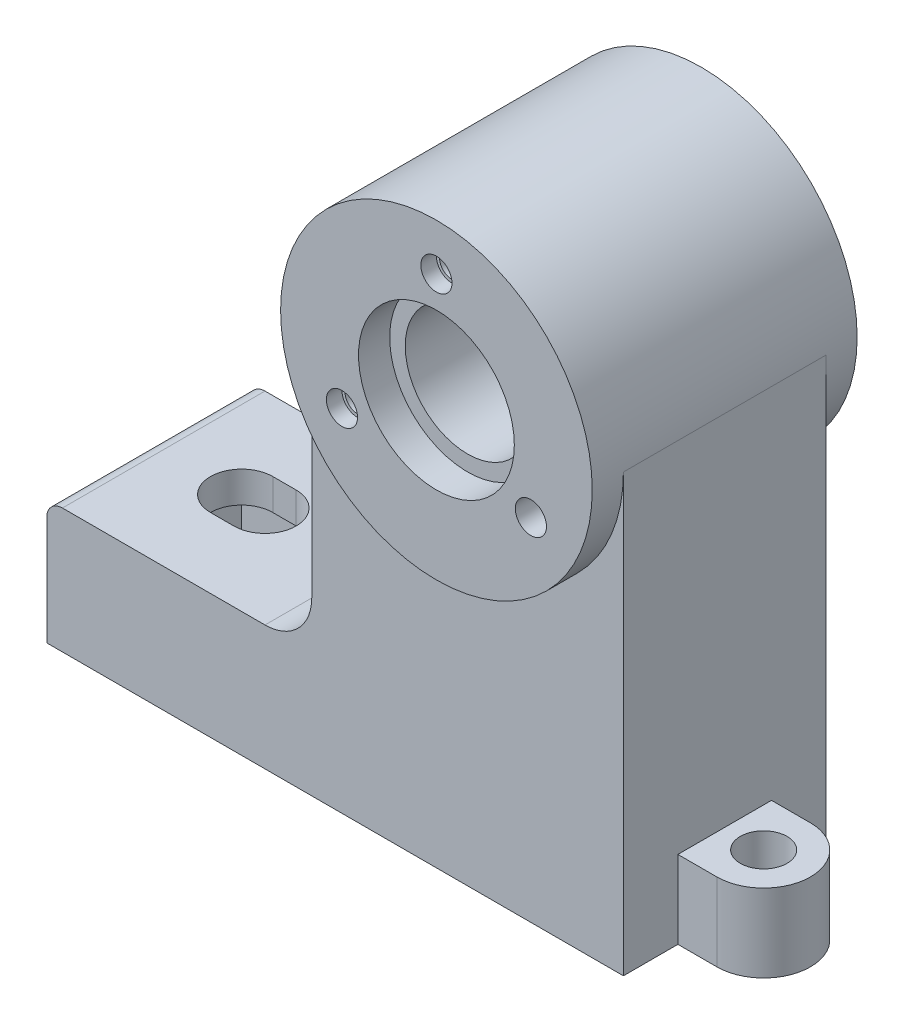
ISO-10303-21;
HEADER;
FILE_DESCRIPTION(('STEP AP214'),'2;1');
FILE_NAME('part.step','',(''),(''),'','','');
FILE_SCHEMA(('AUTOMOTIVE_DESIGN { 1 0 10303 214 1 1 1 1 }'));
ENDSEC;
DATA;
#1=APPLICATION_CONTEXT('core data for automotive mechanical design processes');
#2=APPLICATION_PROTOCOL_DEFINITION('international standard','automotive_design',2000,#1);
#3=PRODUCT_CONTEXT('',#1,'mechanical');
#4=PRODUCT('Part','Part','',(#3));
#5=PRODUCT_RELATED_PRODUCT_CATEGORY('part','',(#4));
#6=PRODUCT_DEFINITION_FORMATION('','',#4);
#7=PRODUCT_DEFINITION_CONTEXT('part definition',#1,'design');
#8=PRODUCT_DEFINITION('design','',#6,#7);
#9=PRODUCT_DEFINITION_SHAPE('','',#8);
#10=(LENGTH_UNIT() NAMED_UNIT(*) SI_UNIT(.MILLI.,.METRE.));
#11=(NAMED_UNIT(*) PLANE_ANGLE_UNIT() SI_UNIT($,.RADIAN.));
#12=(NAMED_UNIT(*) SI_UNIT($,.STERADIAN.) SOLID_ANGLE_UNIT());
#13=UNCERTAINTY_MEASURE_WITH_UNIT(LENGTH_MEASURE(1.E-05),#10,'distance_accuracy_value','');
#14=(GEOMETRIC_REPRESENTATION_CONTEXT(3) GLOBAL_UNCERTAINTY_ASSIGNED_CONTEXT((#13)) GLOBAL_UNIT_ASSIGNED_CONTEXT((#10,
#11,#12)) REPRESENTATION_CONTEXT('',''));
#15=CARTESIAN_POINT('',(0.,0.,0.));
#16=DIRECTION('',(0.,0.,1.));
#17=DIRECTION('',(1.,0.,0.));
#18=AXIS2_PLACEMENT_3D('',#15,#16,#17);
#19=CARTESIAN_POINT('',(0.,0.,8.5));
#20=DIRECTION('',(0.,0.,-1.));
#21=DIRECTION('',(-1.,0.,0.));
#22=AXIS2_PLACEMENT_3D('',#19,#20,#21);
#23=CYLINDRICAL_SURFACE('',#22,4.);
#24=CARTESIAN_POINT('',(0.,0.,6.5));
#25=DIRECTION('',(0.,0.,1.));
#26=DIRECTION('',(1.,0.,0.));
#27=AXIS2_PLACEMENT_3D('',#24,#25,#26);
#28=CIRCLE('',#27,4.);
#29=CARTESIAN_POINT('',(4.,0.,6.5));
#30=VERTEX_POINT('',#29);
#31=EDGE_CURVE('E347',#30,#30,#28,.T.);
#32=ORIENTED_EDGE('',*,*,#31,.T.);
#33=EDGE_LOOP('',(#32));
#34=FACE_BOUND('',#33,.T.);
#35=CARTESIAN_POINT('',(0.,0.,-4.5));
#36=DIRECTION('',(0.,0.,-1.));
#37=DIRECTION('',(-1.,0.,0.));
#38=AXIS2_PLACEMENT_3D('',#35,#36,#37);
#39=CIRCLE('',#38,4.);
#40=CARTESIAN_POINT('',(-4.,0.,-4.5));
#41=VERTEX_POINT('',#40);
#42=EDGE_CURVE('E35',#41,#41,#39,.T.);
#43=ORIENTED_EDGE('',*,*,#42,.T.);
#44=EDGE_LOOP('',(#43));
#45=FACE_BOUND('',#44,.T.);
#46=ADVANCED_FACE('F31',(#34,#45),#23,.F.);
#47=CARTESIAN_POINT('',(-27.,-28.,6.5));
#48=DIRECTION('',(0.,1.,0.));
#49=DIRECTION('',(0.,0.,1.));
#50=AXIS2_PLACEMENT_3D('',#47,#48,#49);
#51=PLANE('',#50);
#52=CARTESIAN_POINT('',(12.5,-28.,0.));
#53=DIRECTION('',(0.,-1.,0.));
#54=DIRECTION('',(0.,0.,-1.));
#55=AXIS2_PLACEMENT_3D('',#52,#53,#54);
#56=CIRCLE('',#55,1.5);
#57=CARTESIAN_POINT('',(12.5,-28.,-1.5));
#58=VERTEX_POINT('',#57);
#59=EDGE_CURVE('E435',#58,#58,#56,.T.);
#60=ORIENTED_EDGE('',*,*,#59,.F.);
#61=EDGE_LOOP('',(#60));
#62=FACE_BOUND('',#61,.T.);
#63=DIRECTION('',(1.,0.,0.));
#64=VECTOR('',#63,1.);
#65=CARTESIAN_POINT('',(-29.,-28.,2.));
#66=LINE('',#65,#64);
#67=CARTESIAN_POINT('',(-29.,-28.,2.));
#68=VERTEX_POINT('',#67);
#69=CARTESIAN_POINT('',(-25.,-28.,2.));
#70=VERTEX_POINT('',#69);
#71=EDGE_CURVE('E526',#68,#70,#66,.T.);
#72=ORIENTED_EDGE('',*,*,#71,.T.);
#73=DIRECTION('',(0.,0.,1.));
#74=VECTOR('',#73,1.);
#75=CARTESIAN_POINT('',(-25.,-28.,-4.));
#76=LINE('',#75,#74);
#77=CARTESIAN_POINT('',(-25.,-28.,4.));
#78=VERTEX_POINT('',#77);
#79=EDGE_CURVE('E436',#70,#78,#76,.T.);
#80=ORIENTED_EDGE('',*,*,#79,.T.);
#81=DIRECTION('',(1.,0.,0.));
#82=VECTOR('',#81,1.);
#83=CARTESIAN_POINT('',(8.,-28.,4.));
#84=LINE('',#83,#82);
#85=CARTESIAN_POINT('',(8.,-28.,4.));
#86=VERTEX_POINT('',#85);
#87=EDGE_CURVE('E391',#78,#86,#84,.T.);
#88=ORIENTED_EDGE('',*,*,#87,.T.);
#89=DIRECTION('',(0.,0.,1.));
#90=VECTOR('',#89,1.);
#91=CARTESIAN_POINT('',(8.,-28.,-4.));
#92=LINE('',#91,#90);
#93=CARTESIAN_POINT('',(8.,-28.,-4.));
#94=VERTEX_POINT('',#93);
#95=EDGE_CURVE('E413',#94,#86,#92,.T.);
#96=ORIENTED_EDGE('',*,*,#95,.F.);
#97=DIRECTION('',(1.,0.,0.));
#98=VECTOR('',#97,1.);
#99=CARTESIAN_POINT('',(8.,-28.,-4.));
#100=LINE('',#99,#98);
#101=CARTESIAN_POINT('',(-25.,-28.,-4.));
#102=VERTEX_POINT('',#101);
#103=EDGE_CURVE('E392',#102,#94,#100,.T.);
#104=ORIENTED_EDGE('',*,*,#103,.F.);
#105=CARTESIAN_POINT('',(-25.,-28.,-1.99999999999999));
#106=VERTEX_POINT('',#105);
#107=EDGE_CURVE('E432',#102,#106,#76,.T.);
#108=ORIENTED_EDGE('',*,*,#107,.T.);
#109=DIRECTION('',(1.,0.,0.));
#110=VECTOR('',#109,1.);
#111=CARTESIAN_POINT('',(-29.,-28.,-2.));
#112=LINE('',#111,#110);
#113=CARTESIAN_POINT('',(-29.,-28.,-2.));
#114=VERTEX_POINT('',#113);
#115=EDGE_CURVE('E621',#114,#106,#112,.T.);
#116=ORIENTED_EDGE('',*,*,#115,.F.);
#117=DIRECTION('',(0.,0.,1.));
#118=VECTOR('',#117,1.);
#119=CARTESIAN_POINT('',(-29.,-28.,-3.));
#120=LINE('',#119,#118);
#121=CARTESIAN_POINT('',(-29.,-28.,-3.));
#122=VERTEX_POINT('',#121);
#123=EDGE_CURVE('E483',#122,#114,#120,.T.);
#124=ORIENTED_EDGE('',*,*,#123,.F.);
#125=DIRECTION('',(1.,0.,0.));
#126=VECTOR('',#125,1.);
#127=CARTESIAN_POINT('',(-29.,-28.,-3.));
#128=LINE('',#127,#126);
#129=CARTESIAN_POINT('',(-27.,-28.,-2.99999999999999));
#130=VERTEX_POINT('',#129);
#131=EDGE_CURVE('E501',#122,#130,#128,.T.);
#132=ORIENTED_EDGE('',*,*,#131,.T.);
#133=DIRECTION('',(0.,0.,-1.));
#134=VECTOR('',#133,1.);
#135=CARTESIAN_POINT('',(-27.,-28.,6.5));
#136=LINE('',#135,#134);
#137=CARTESIAN_POINT('',(-27.,-28.,-6.5));
#138=VERTEX_POINT('',#137);
#139=EDGE_CURVE('E589',#130,#138,#136,.T.);
#140=ORIENTED_EDGE('',*,*,#139,.T.);
#141=DIRECTION('',(1.,0.,0.));
#142=VECTOR('',#141,1.);
#143=CARTESIAN_POINT('',(-27.,-28.,-6.5));
#144=LINE('',#143,#142);
#145=CARTESIAN_POINT('',(10.,-28.,-6.5));
#146=VERTEX_POINT('',#145);
#147=EDGE_CURVE('E633',#138,#146,#144,.T.);
#148=ORIENTED_EDGE('',*,*,#147,.T.);
#149=DIRECTION('',(0.,0.,-1.));
#150=VECTOR('',#149,1.);
#151=CARTESIAN_POINT('',(10.,-28.,6.5));
#152=LINE('',#151,#150);
#153=CARTESIAN_POINT('',(10.,-28.,-3.00365872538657));
#154=VERTEX_POINT('',#153);
#155=EDGE_CURVE('E637',#154,#146,#152,.T.);
#156=ORIENTED_EDGE('',*,*,#155,.F.);
#157=DIRECTION('',(1.,0.,0.));
#158=VECTOR('',#157,1.);
#159=CARTESIAN_POINT('',(12.5,-28.,-3.00365872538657));
#160=LINE('',#159,#158);
#161=CARTESIAN_POINT('',(12.5,-28.,-3.00365872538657));
#162=VERTEX_POINT('',#161);
#163=EDGE_CURVE('E450',#154,#162,#160,.T.);
#164=ORIENTED_EDGE('',*,*,#163,.T.);
#165=CARTESIAN_POINT('',(12.5,-28.,0.));
#166=DIRECTION('',(0.,-1.,0.));
#167=DIRECTION('',(0.,0.,1.));
#168=AXIS2_PLACEMENT_3D('',#165,#166,#167);
#169=CIRCLE('',#168,3.00365872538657);
#170=CARTESIAN_POINT('',(12.5,-28.,3.00365872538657));
#171=VERTEX_POINT('',#170);
#172=EDGE_CURVE('E468',#162,#171,#169,.T.);
#173=ORIENTED_EDGE('',*,*,#172,.T.);
#174=DIRECTION('',(-1.,0.,0.));
#175=VECTOR('',#174,1.);
#176=CARTESIAN_POINT('',(10.,-28.,3.00365872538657));
#177=LINE('',#176,#175);
#178=CARTESIAN_POINT('',(10.,-28.,3.00365872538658));
#179=VERTEX_POINT('',#178);
#180=EDGE_CURVE('E456',#171,#179,#177,.T.);
#181=ORIENTED_EDGE('',*,*,#180,.T.);
#182=CARTESIAN_POINT('',(10.,-28.,6.5));
#183=VERTEX_POINT('',#182);
#184=EDGE_CURVE('E593',#183,#179,#152,.T.);
#185=ORIENTED_EDGE('',*,*,#184,.F.);
#186=DIRECTION('',(1.,0.,0.));
#187=VECTOR('',#186,1.);
#188=CARTESIAN_POINT('',(-27.,-28.,6.5));
#189=LINE('',#188,#187);
#190=CARTESIAN_POINT('',(-27.,-28.,6.5));
#191=VERTEX_POINT('',#190);
#192=EDGE_CURVE('E639',#191,#183,#189,.T.);
#193=ORIENTED_EDGE('',*,*,#192,.F.);
#194=CARTESIAN_POINT('',(-27.,-28.,3.));
#195=VERTEX_POINT('',#194);
#196=EDGE_CURVE('E584',#191,#195,#136,.T.);
#197=ORIENTED_EDGE('',*,*,#196,.T.);
#198=DIRECTION('',(1.,0.,0.));
#199=VECTOR('',#198,1.);
#200=CARTESIAN_POINT('',(-29.,-28.,3.));
#201=LINE('',#200,#199);
#202=CARTESIAN_POINT('',(-29.,-28.,3.));
#203=VERTEX_POINT('',#202);
#204=EDGE_CURVE('E523',#203,#195,#201,.T.);
#205=ORIENTED_EDGE('',*,*,#204,.F.);
#206=DIRECTION('',(0.,0.,1.));
#207=VECTOR('',#206,1.);
#208=CARTESIAN_POINT('',(-29.,-28.,2.));
#209=LINE('',#208,#207);
#210=EDGE_CURVE('E493',#68,#203,#209,.T.);
#211=ORIENTED_EDGE('',*,*,#210,.F.);
#212=EDGE_LOOP('',(#72,#80,#88,#96,#104,#108,#116,#124,#132,#140,#148,#156,#164,#173,#181,#185,
#193,#197,#205,#211));
#213=FACE_BOUND('',#212,.T.);
#214=ADVANCED_FACE('F674',(#62,#213),#51,.F.);
#215=CARTESIAN_POINT('',(-27.,-20.,6.5));
#216=DIRECTION('',(1.,0.,0.));
#217=DIRECTION('',(0.,0.,-1.));
#218=AXIS2_PLACEMENT_3D('',#215,#216,#217);
#219=PLANE('',#218);
#220=DIRECTION('',(0.,-1.,0.));
#221=VECTOR('',#220,1.);
#222=CARTESIAN_POINT('',(-27.,-20.,6.5));
#223=LINE('',#222,#221);
#224=CARTESIAN_POINT('',(-27.,-21.,6.5));
#225=VERTEX_POINT('',#224);
#226=EDGE_CURVE('E642',#225,#191,#223,.T.);
#227=ORIENTED_EDGE('',*,*,#226,.F.);
#228=DIRECTION('',(0.,0.,-1.));
#229=VECTOR('',#228,1.);
#230=CARTESIAN_POINT('',(-27.,-21.,6.5));
#231=LINE('',#230,#229);
#232=CARTESIAN_POINT('',(-27.,-21.,-6.5));
#233=VERTEX_POINT('',#232);
#234=EDGE_CURVE('E544',#225,#233,#231,.T.);
#235=ORIENTED_EDGE('',*,*,#234,.T.);
#236=DIRECTION('',(0.,-1.,0.));
#237=VECTOR('',#236,1.);
#238=CARTESIAN_POINT('',(-27.,-20.,-6.5));
#239=LINE('',#238,#237);
#240=EDGE_CURVE('E631',#233,#138,#239,.T.);
#241=ORIENTED_EDGE('',*,*,#240,.T.);
#242=ORIENTED_EDGE('',*,*,#139,.F.);
#243=DIRECTION('',(0.,-1.,0.));
#244=VECTOR('',#243,1.);
#245=CARTESIAN_POINT('',(-27.,-28.,-3.));
#246=LINE('',#245,#244);
#247=CARTESIAN_POINT('',(-27.,-26.,-3.));
#248=VERTEX_POINT('',#247);
#249=EDGE_CURVE('E487',#248,#130,#246,.T.);
#250=ORIENTED_EDGE('',*,*,#249,.F.);
#251=CARTESIAN_POINT('',(-27.,-26.,0.));
#252=DIRECTION('',(-1.,0.,0.));
#253=DIRECTION('',(0.,0.,-1.));
#254=AXIS2_PLACEMENT_3D('',#251,#252,#253);
#255=CIRCLE('',#254,3.);
#256=CARTESIAN_POINT('',(-27.,-26.,3.));
#257=VERTEX_POINT('',#256);
#258=EDGE_CURVE('E502',#257,#248,#255,.T.);
#259=ORIENTED_EDGE('',*,*,#258,.F.);
#260=DIRECTION('',(0.,1.,0.));
#261=VECTOR('',#260,1.);
#262=CARTESIAN_POINT('',(-27.,-26.,3.));
#263=LINE('',#262,#261);
#264=EDGE_CURVE('E476',#195,#257,#263,.T.);
#265=ORIENTED_EDGE('',*,*,#264,.F.);
#266=ORIENTED_EDGE('',*,*,#196,.F.);
#267=EDGE_LOOP('',(#227,#235,#241,#242,#250,#259,#265,#266));
#268=FACE_BOUND('',#267,.T.);
#269=ADVANCED_FACE('F570',(#268),#219,.F.);
#270=CARTESIAN_POINT('',(0.,0.,8.5));
#271=DIRECTION('',(0.,0.,1.));
#272=DIRECTION('',(1.,0.,0.));
#273=AXIS2_PLACEMENT_3D('',#270,#271,#272);
#274=PLANE('',#273);
#275=CARTESIAN_POINT('',(-6.06217782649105,-3.50000000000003,8.5));
#276=DIRECTION('',(0.,0.,1.));
#277=DIRECTION('',(1.,0.,0.));
#278=AXIS2_PLACEMENT_3D('',#275,#276,#277);
#279=CIRCLE('',#278,0.999999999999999);
#280=CARTESIAN_POINT('',(-5.06217782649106,-3.50000000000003,8.5));
#281=VERTEX_POINT('',#280);
#282=EDGE_CURVE('E320',#281,#281,#279,.T.);
#283=ORIENTED_EDGE('',*,*,#282,.F.);
#284=EDGE_LOOP('',(#283));
#285=FACE_BOUND('',#284,.T.);
#286=CARTESIAN_POINT('',(6.06217782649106,-3.50000000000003,8.5));
#287=DIRECTION('',(0.,0.,1.));
#288=DIRECTION('',(1.,0.,0.));
#289=AXIS2_PLACEMENT_3D('',#286,#287,#288);
#290=CIRCLE('',#289,0.999999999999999);
#291=CARTESIAN_POINT('',(7.06217782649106,-3.50000000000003,8.5));
#292=VERTEX_POINT('',#291);
#293=EDGE_CURVE('E323',#292,#292,#290,.T.);
#294=ORIENTED_EDGE('',*,*,#293,.F.);
#295=EDGE_LOOP('',(#294));
#296=FACE_BOUND('',#295,.T.);
#297=CARTESIAN_POINT('',(0.,7.,8.5));
#298=DIRECTION('',(0.,0.,1.));
#299=DIRECTION('',(1.,0.,0.));
#300=AXIS2_PLACEMENT_3D('',#297,#298,#299);
#301=CIRCLE('',#300,0.999999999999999);
#302=CARTESIAN_POINT('',(0.999999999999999,7.,8.5));
#303=VERTEX_POINT('',#302);
#304=EDGE_CURVE('E335',#303,#303,#301,.T.);
#305=ORIENTED_EDGE('',*,*,#304,.F.);
#306=EDGE_LOOP('',(#305));
#307=FACE_BOUND('',#306,.T.);
#308=CARTESIAN_POINT('',(0.,0.,8.5));
#309=DIRECTION('',(0.,0.,1.));
#310=DIRECTION('',(1.,0.,0.));
#311=AXIS2_PLACEMENT_3D('',#308,#309,#310);
#312=CIRCLE('',#311,5.);
#313=CARTESIAN_POINT('',(5.,0.,8.5));
#314=VERTEX_POINT('',#313);
#315=EDGE_CURVE('E348',#314,#314,#312,.T.);
#316=ORIENTED_EDGE('',*,*,#315,.F.);
#317=EDGE_LOOP('',(#316));
#318=FACE_BOUND('',#317,.T.);
#319=CARTESIAN_POINT('',(0.,0.,8.5));
#320=DIRECTION('',(0.,0.,1.));
#321=DIRECTION('',(1.,0.,0.));
#322=AXIS2_PLACEMENT_3D('',#319,#320,#321);
#323=CIRCLE('',#322,10.);
#324=CARTESIAN_POINT('',(10.,0.,8.5));
#325=VERTEX_POINT('',#324);
#326=EDGE_CURVE('E538',#325,#325,#323,.T.);
#327=ORIENTED_EDGE('',*,*,#326,.T.);
#328=EDGE_LOOP('',(#327));
#329=FACE_BOUND('',#328,.T.);
#330=ADVANCED_FACE('F566',(#285,#296,#307,#318,#329),#274,.T.);
#331=CARTESIAN_POINT('',(0.,0.,-8.5));
#332=DIRECTION('',(0.,0.,1.));
#333=DIRECTION('',(1.,0.,0.));
#334=AXIS2_PLACEMENT_3D('',#331,#332,#333);
#335=PLANE('',#334);
#336=CARTESIAN_POINT('',(-6.06217782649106,-3.50000000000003,-8.5));
#337=DIRECTION('',(0.,0.,-1.));
#338=DIRECTION('',(-1.,0.,0.));
#339=AXIS2_PLACEMENT_3D('',#336,#337,#338);
#340=CIRCLE('',#339,0.999999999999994);
#341=CARTESIAN_POINT('',(-7.06217782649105,-3.50000000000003,-8.5));
#342=VERTEX_POINT('',#341);
#343=EDGE_CURVE('E275',#342,#342,#340,.T.);
#344=ORIENTED_EDGE('',*,*,#343,.F.);
#345=EDGE_LOOP('',(#344));
#346=FACE_BOUND('',#345,.T.);
#347=CARTESIAN_POINT('',(6.06217782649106,-3.50000000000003,-8.5));
#348=DIRECTION('',(0.,0.,-1.));
#349=DIRECTION('',(-1.,0.,0.));
#350=AXIS2_PLACEMENT_3D('',#347,#348,#349);
#351=CIRCLE('',#350,0.999999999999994);
#352=CARTESIAN_POINT('',(5.06217782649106,-3.50000000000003,-8.5));
#353=VERTEX_POINT('',#352);
#354=EDGE_CURVE('E287',#353,#353,#351,.T.);
#355=ORIENTED_EDGE('',*,*,#354,.F.);
#356=EDGE_LOOP('',(#355));
#357=FACE_BOUND('',#356,.T.);
#358=CARTESIAN_POINT('',(0.,7.,-8.5));
#359=DIRECTION('',(0.,0.,-1.));
#360=DIRECTION('',(-1.,0.,0.));
#361=AXIS2_PLACEMENT_3D('',#358,#359,#360);
#362=CIRCLE('',#361,0.999999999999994);
#363=CARTESIAN_POINT('',(-0.999999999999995,7.,-8.5));
#364=VERTEX_POINT('',#363);
#365=EDGE_CURVE('E299',#364,#364,#362,.T.);
#366=ORIENTED_EDGE('',*,*,#365,.F.);
#367=EDGE_LOOP('',(#366));
#368=FACE_BOUND('',#367,.T.);
#369=CARTESIAN_POINT('',(0.,0.,-8.5));
#370=DIRECTION('',(0.,0.,-1.));
#371=DIRECTION('',(-1.,0.,0.));
#372=AXIS2_PLACEMENT_3D('',#369,#370,#371);
#373=CIRCLE('',#372,5.);
#374=CARTESIAN_POINT('',(-5.,0.,-8.5));
#375=VERTEX_POINT('',#374);
#376=EDGE_CURVE('E338',#375,#375,#373,.T.);
#377=ORIENTED_EDGE('',*,*,#376,.F.);
#378=EDGE_LOOP('',(#377));
#379=FACE_BOUND('',#378,.T.);
#380=CARTESIAN_POINT('',(0.,0.,-8.5));
#381=DIRECTION('',(0.,0.,1.));
#382=DIRECTION('',(1.,0.,0.));
#383=AXIS2_PLACEMENT_3D('',#380,#381,#382);
#384=CIRCLE('',#383,10.);
#385=CARTESIAN_POINT('',(10.,0.,-8.5));
#386=VERTEX_POINT('',#385);
#387=EDGE_CURVE('E576',#386,#386,#384,.T.);
#388=ORIENTED_EDGE('',*,*,#387,.F.);
#389=EDGE_LOOP('',(#388));
#390=FACE_BOUND('',#389,.T.);
#391=ADVANCED_FACE('F569',(#346,#357,#368,#379,#390),#335,.F.);
#392=CARTESIAN_POINT('',(0.,0.,8.5));
#393=DIRECTION('',(0.,0.,-1.));
#394=DIRECTION('',(-1.,0.,0.));
#395=AXIS2_PLACEMENT_3D('',#392,#393,#394);
#396=CYLINDRICAL_SURFACE('',#395,10.);
#397=DIRECTION('',(0.,0.,-1.));
#398=VECTOR('',#397,1.);
#399=CARTESIAN_POINT('',(-10.,0.,6.5));
#400=LINE('',#399,#398);
#401=CARTESIAN_POINT('',(-10.,0.,6.5));
#402=VERTEX_POINT('',#401);
#403=CARTESIAN_POINT('',(-10.,0.,-6.5));
#404=VERTEX_POINT('',#403);
#405=EDGE_CURVE('E579',#402,#404,#400,.T.);
#406=ORIENTED_EDGE('',*,*,#405,.F.);
#407=CARTESIAN_POINT('',(0.,0.,6.5));
#408=DIRECTION('',(0.,0.,-1.));
#409=DIRECTION('',(1.,0.,0.));
#410=AXIS2_PLACEMENT_3D('',#407,#408,#409);
#411=CIRCLE('',#410,10.);
#412=CARTESIAN_POINT('',(10.,0.,6.5));
#413=VERTEX_POINT('',#412);
#414=EDGE_CURVE('E613',#413,#402,#411,.T.);
#415=ORIENTED_EDGE('',*,*,#414,.F.);
#416=DIRECTION('',(0.,0.,-1.));
#417=VECTOR('',#416,1.);
#418=CARTESIAN_POINT('',(10.,0.,6.5));
#419=LINE('',#418,#417);
#420=CARTESIAN_POINT('',(10.,0.,-6.5));
#421=VERTEX_POINT('',#420);
#422=EDGE_CURVE('E618',#413,#421,#419,.T.);
#423=ORIENTED_EDGE('',*,*,#422,.T.);
#424=CARTESIAN_POINT('',(0.,0.,-6.5));
#425=DIRECTION('',(0.,0.,-1.));
#426=DIRECTION('',(1.,0.,0.));
#427=AXIS2_PLACEMENT_3D('',#424,#425,#426);
#428=CIRCLE('',#427,10.);
#429=EDGE_CURVE('E616',#421,#404,#428,.T.);
#430=ORIENTED_EDGE('',*,*,#429,.T.);
#431=EDGE_LOOP('',(#406,#415,#423,#430));
#432=FACE_BOUND('',#431,.T.);
#433=ORIENTED_EDGE('',*,*,#326,.F.);
#434=EDGE_LOOP('',(#433));
#435=FACE_BOUND('',#434,.T.);
#436=ORIENTED_EDGE('',*,*,#387,.T.);
#437=EDGE_LOOP('',(#436));
#438=FACE_BOUND('',#437,.T.);
#439=ADVANCED_FACE('F612',(#432,#435,#438),#396,.T.);
#440=CARTESIAN_POINT('',(-10.,0.,6.5));
#441=DIRECTION('',(1.,0.,0.));
#442=DIRECTION('',(0.,0.,-1.));
#443=AXIS2_PLACEMENT_3D('',#440,#441,#442);
#444=PLANE('',#443);
#445=DIRECTION('',(0.,-1.,0.));
#446=VECTOR('',#445,1.);
#447=CARTESIAN_POINT('',(-10.,0.,-6.5));
#448=LINE('',#447,#446);
#449=CARTESIAN_POINT('',(-10.,-17.,-6.5));
#450=VERTEX_POINT('',#449);
#451=EDGE_CURVE('E608',#404,#450,#448,.T.);
#452=ORIENTED_EDGE('',*,*,#451,.T.);
#453=DIRECTION('',(0.,0.,-1.));
#454=VECTOR('',#453,1.);
#455=CARTESIAN_POINT('',(-10.,-17.,6.5));
#456=LINE('',#455,#454);
#457=CARTESIAN_POINT('',(-10.,-17.,6.5));
#458=VERTEX_POINT('',#457);
#459=EDGE_CURVE('E597',#458,#450,#456,.T.);
#460=ORIENTED_EDGE('',*,*,#459,.F.);
#461=DIRECTION('',(0.,-1.,0.));
#462=VECTOR('',#461,1.);
#463=CARTESIAN_POINT('',(-10.,0.,6.5));
#464=LINE('',#463,#462);
#465=EDGE_CURVE('E609',#402,#458,#464,.T.);
#466=ORIENTED_EDGE('',*,*,#465,.F.);
#467=ORIENTED_EDGE('',*,*,#405,.T.);
#468=EDGE_LOOP('',(#452,#460,#466,#467));
#469=FACE_BOUND('',#468,.T.);
#470=ADVANCED_FACE('F606',(#469),#444,.F.);
#471=CARTESIAN_POINT('',(-13.,-17.,6.5));
#472=DIRECTION('',(0.,0.,-1.));
#473=DIRECTION('',(-1.,0.,0.));
#474=AXIS2_PLACEMENT_3D('',#471,#472,#473);
#475=CYLINDRICAL_SURFACE('',#474,3.);
#476=CARTESIAN_POINT('',(-13.,-17.,-6.5));
#477=DIRECTION('',(0.,0.,-1.));
#478=DIRECTION('',(-1.,0.,0.));
#479=AXIS2_PLACEMENT_3D('',#476,#477,#478);
#480=CIRCLE('',#479,3.);
#481=CARTESIAN_POINT('',(-13.,-20.,-6.5));
#482=VERTEX_POINT('',#481);
#483=EDGE_CURVE('E624',#450,#482,#480,.T.);
#484=ORIENTED_EDGE('',*,*,#483,.T.);
#485=DIRECTION('',(0.,0.,-1.));
#486=VECTOR('',#485,1.);
#487=CARTESIAN_POINT('',(-13.,-20.,6.5));
#488=LINE('',#487,#486);
#489=CARTESIAN_POINT('',(-13.,-20.,6.5));
#490=VERTEX_POINT('',#489);
#491=EDGE_CURVE('E588',#490,#482,#488,.T.);
#492=ORIENTED_EDGE('',*,*,#491,.F.);
#493=CARTESIAN_POINT('',(-13.,-17.,6.5));
#494=DIRECTION('',(0.,0.,-1.));
#495=DIRECTION('',(-1.,0.,0.));
#496=AXIS2_PLACEMENT_3D('',#493,#494,#495);
#497=CIRCLE('',#496,3.);
#498=EDGE_CURVE('E648',#458,#490,#497,.T.);
#499=ORIENTED_EDGE('',*,*,#498,.F.);
#500=ORIENTED_EDGE('',*,*,#459,.T.);
#501=EDGE_LOOP('',(#484,#492,#499,#500));
#502=FACE_BOUND('',#501,.T.);
#503=ADVANCED_FACE('F683',(#502),#475,.F.);
#504=CARTESIAN_POINT('',(-13.,-20.,6.5));
#505=DIRECTION('',(0.,-1.,0.));
#506=DIRECTION('',(0.,0.,-1.));
#507=AXIS2_PLACEMENT_3D('',#504,#505,#506);
#508=PLANE('',#507);
#509=DIRECTION('',(1.,0.,0.));
#510=VECTOR('',#509,1.);
#511=CARTESIAN_POINT('',(-19.5,-20.,2.));
#512=LINE('',#511,#510);
#513=CARTESIAN_POINT('',(-21.,-20.,2.));
#514=VERTEX_POINT('',#513);
#515=CARTESIAN_POINT('',(-19.5,-20.,2.));
#516=VERTEX_POINT('',#515);
#517=EDGE_CURVE('E361',#514,#516,#512,.T.);
#518=ORIENTED_EDGE('',*,*,#517,.F.);
#519=CARTESIAN_POINT('',(-21.,-20.,0.));
#520=DIRECTION('',(0.,1.,0.));
#521=DIRECTION('',(0.,0.,-1.));
#522=AXIS2_PLACEMENT_3D('',#519,#520,#521);
#523=CIRCLE('',#522,2.);
#524=CARTESIAN_POINT('',(-21.,-20.,-2.));
#525=VERTEX_POINT('',#524);
#526=EDGE_CURVE('E359',#525,#514,#523,.T.);
#527=ORIENTED_EDGE('',*,*,#526,.F.);
#528=DIRECTION('',(-1.,0.,0.));
#529=VECTOR('',#528,1.);
#530=CARTESIAN_POINT('',(-21.,-20.,-2.));
#531=LINE('',#530,#529);
#532=CARTESIAN_POINT('',(-19.5,-20.,-2.));
#533=VERTEX_POINT('',#532);
#534=EDGE_CURVE('E367',#533,#525,#531,.T.);
#535=ORIENTED_EDGE('',*,*,#534,.F.);
#536=CARTESIAN_POINT('',(-19.5,-20.,0.));
#537=DIRECTION('',(0.,1.,0.));
#538=DIRECTION('',(0.,0.,-1.));
#539=AXIS2_PLACEMENT_3D('',#536,#537,#538);
#540=CIRCLE('',#539,2.);
#541=EDGE_CURVE('E364',#516,#533,#540,.T.);
#542=ORIENTED_EDGE('',*,*,#541,.F.);
#543=EDGE_LOOP('',(#518,#527,#535,#542));
#544=FACE_BOUND('',#543,.T.);
#545=DIRECTION('',(-1.,0.,0.));
#546=VECTOR('',#545,1.);
#547=CARTESIAN_POINT('',(-13.,-20.,-6.5));
#548=LINE('',#547,#546);
#549=CARTESIAN_POINT('',(-26.,-20.,-6.5));
#550=VERTEX_POINT('',#549);
#551=EDGE_CURVE('E626',#482,#550,#548,.T.);
#552=ORIENTED_EDGE('',*,*,#551,.T.);
#553=DIRECTION('',(0.,0.,-1.));
#554=VECTOR('',#553,1.);
#555=CARTESIAN_POINT('',(-26.,-20.,6.5));
#556=LINE('',#555,#554);
#557=CARTESIAN_POINT('',(-26.,-20.,6.5));
#558=VERTEX_POINT('',#557);
#559=EDGE_CURVE('E40',#550,#558,#556,.F.);
#560=ORIENTED_EDGE('',*,*,#559,.T.);
#561=DIRECTION('',(-1.,0.,0.));
#562=VECTOR('',#561,1.);
#563=CARTESIAN_POINT('',(-13.,-20.,6.5));
#564=LINE('',#563,#562);
#565=EDGE_CURVE('E646',#490,#558,#564,.T.);
#566=ORIENTED_EDGE('',*,*,#565,.F.);
#567=ORIENTED_EDGE('',*,*,#491,.T.);
#568=EDGE_LOOP('',(#552,#560,#566,#567));
#569=FACE_BOUND('',#568,.T.);
#570=ADVANCED_FACE('F682',(#544,#569),#508,.F.);
#571=CARTESIAN_POINT('',(10.,-28.,6.5));
#572=DIRECTION('',(-1.,0.,0.));
#573=DIRECTION('',(0.,0.,1.));
#574=AXIS2_PLACEMENT_3D('',#571,#572,#573);
#575=PLANE('',#574);
#576=ORIENTED_EDGE('',*,*,#184,.T.);
#577=DIRECTION('',(0.,-1.,0.));
#578=VECTOR('',#577,1.);
#579=CARTESIAN_POINT('',(10.,-23.,3.00365872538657));
#580=LINE('',#579,#578);
#581=CARTESIAN_POINT('',(10.,-23.,3.00365872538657));
#582=VERTEX_POINT('',#581);
#583=EDGE_CURVE('E473',#582,#179,#580,.T.);
#584=ORIENTED_EDGE('',*,*,#583,.F.);
#585=DIRECTION('',(0.,0.,-1.));
#586=VECTOR('',#585,1.);
#587=CARTESIAN_POINT('',(10.,-23.,-3.00365872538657));
#588=LINE('',#587,#586);
#589=CARTESIAN_POINT('',(10.,-23.,-3.00365872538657));
#590=VERTEX_POINT('',#589);
#591=EDGE_CURVE('E453',#582,#590,#588,.T.);
#592=ORIENTED_EDGE('',*,*,#591,.T.);
#593=DIRECTION('',(0.,-1.,0.));
#594=VECTOR('',#593,1.);
#595=CARTESIAN_POINT('',(10.,-23.,-3.00365872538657));
#596=LINE('',#595,#594);
#597=EDGE_CURVE('E465',#590,#154,#596,.T.);
#598=ORIENTED_EDGE('',*,*,#597,.T.);
#599=ORIENTED_EDGE('',*,*,#155,.T.);
#600=DIRECTION('',(0.,1.,0.));
#601=VECTOR('',#600,1.);
#602=CARTESIAN_POINT('',(10.,-28.,-6.5));
#603=LINE('',#602,#601);
#604=EDGE_CURVE('E636',#146,#421,#603,.T.);
#605=ORIENTED_EDGE('',*,*,#604,.T.);
#606=ORIENTED_EDGE('',*,*,#422,.F.);
#607=DIRECTION('',(0.,1.,0.));
#608=VECTOR('',#607,1.);
#609=CARTESIAN_POINT('',(10.,-28.,6.5));
#610=LINE('',#609,#608);
#611=EDGE_CURVE('E638',#183,#413,#610,.T.);
#612=ORIENTED_EDGE('',*,*,#611,.F.);
#613=EDGE_LOOP('',(#576,#584,#592,#598,#599,#605,#606,#612));
#614=FACE_BOUND('',#613,.T.);
#615=ADVANCED_FACE('F690',(#614),#575,.F.);
#616=CARTESIAN_POINT('',(0.,0.,6.5));
#617=DIRECTION('',(0.,0.,1.));
#618=DIRECTION('',(1.,0.,0.));
#619=AXIS2_PLACEMENT_3D('',#616,#617,#618);
#620=PLANE('',#619);
#621=ORIENTED_EDGE('',*,*,#565,.T.);
#622=CARTESIAN_POINT('',(-26.,-21.,6.5));
#623=DIRECTION('',(0.,0.,1.));
#624=DIRECTION('',(1.,0.,0.));
#625=AXIS2_PLACEMENT_3D('',#622,#623,#624);
#626=CIRCLE('',#625,1.);
#627=EDGE_CURVE('E11',#558,#225,#626,.T.);
#628=ORIENTED_EDGE('',*,*,#627,.T.);
#629=ORIENTED_EDGE('',*,*,#226,.T.);
#630=ORIENTED_EDGE('',*,*,#192,.T.);
#631=ORIENTED_EDGE('',*,*,#611,.T.);
#632=ORIENTED_EDGE('',*,*,#414,.T.);
#633=ORIENTED_EDGE('',*,*,#465,.T.);
#634=ORIENTED_EDGE('',*,*,#498,.T.);
#635=EDGE_LOOP('',(#621,#628,#629,#630,#631,#632,#633,#634));
#636=FACE_BOUND('',#635,.T.);
#637=ADVANCED_FACE('F680',(#636),#620,.T.);
#638=CARTESIAN_POINT('',(0.,0.,-6.5));
#639=DIRECTION('',(0.,0.,1.));
#640=DIRECTION('',(1.,0.,0.));
#641=AXIS2_PLACEMENT_3D('',#638,#639,#640);
#642=PLANE('',#641);
#643=ORIENTED_EDGE('',*,*,#240,.F.);
#644=CARTESIAN_POINT('',(-26.,-21.,-6.5));
#645=DIRECTION('',(0.,0.,1.));
#646=DIRECTION('',(1.,0.,0.));
#647=AXIS2_PLACEMENT_3D('',#644,#645,#646);
#648=CIRCLE('',#647,1.);
#649=EDGE_CURVE('E55',#233,#550,#648,.F.);
#650=ORIENTED_EDGE('',*,*,#649,.T.);
#651=ORIENTED_EDGE('',*,*,#551,.F.);
#652=ORIENTED_EDGE('',*,*,#483,.F.);
#653=ORIENTED_EDGE('',*,*,#451,.F.);
#654=ORIENTED_EDGE('',*,*,#429,.F.);
#655=ORIENTED_EDGE('',*,*,#604,.F.);
#656=ORIENTED_EDGE('',*,*,#147,.F.);
#657=EDGE_LOOP('',(#643,#650,#651,#652,#653,#654,#655,#656));
#658=FACE_BOUND('',#657,.T.);
#659=ADVANCED_FACE('F623',(#658),#642,.F.);
#660=CARTESIAN_POINT('',(-29.,-28.,-2.));
#661=DIRECTION('',(0.,0.,-1.));
#662=DIRECTION('',(-1.,0.,0.));
#663=AXIS2_PLACEMENT_3D('',#660,#661,#662);
#664=PLANE('',#663);
#665=ORIENTED_EDGE('',*,*,#115,.T.);
#666=DIRECTION('',(0.,1.,0.));
#667=VECTOR('',#666,1.);
#668=CARTESIAN_POINT('',(-25.,-28.,-1.99999999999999));
#669=LINE('',#668,#667);
#670=CARTESIAN_POINT('',(-25.,-26.,-2.));
#671=VERTEX_POINT('',#670);
#672=EDGE_CURVE('E388',#106,#671,#669,.T.);
#673=ORIENTED_EDGE('',*,*,#672,.T.);
#674=DIRECTION('',(1.,0.,0.));
#675=VECTOR('',#674,1.);
#676=CARTESIAN_POINT('',(-29.,-26.,-2.));
#677=LINE('',#676,#675);
#678=CARTESIAN_POINT('',(-29.,-26.,-2.));
#679=VERTEX_POINT('',#678);
#680=EDGE_CURVE('E652',#679,#671,#677,.T.);
#681=ORIENTED_EDGE('',*,*,#680,.F.);
#682=DIRECTION('',(0.,1.,0.));
#683=VECTOR('',#682,1.);
#684=CARTESIAN_POINT('',(-29.,-28.,-2.));
#685=LINE('',#684,#683);
#686=EDGE_CURVE('E486',#114,#679,#685,.T.);
#687=ORIENTED_EDGE('',*,*,#686,.F.);
#688=EDGE_LOOP('',(#665,#673,#681,#687));
#689=FACE_BOUND('',#688,.T.);
#690=ADVANCED_FACE('F766',(#689),#664,.F.);
#691=CARTESIAN_POINT('',(-29.,-26.,0.));
#692=DIRECTION('',(1.,0.,0.));
#693=DIRECTION('',(0.,0.,-1.));
#694=AXIS2_PLACEMENT_3D('',#691,#692,#693);
#695=CYLINDRICAL_SURFACE('',#694,2.);
#696=ORIENTED_EDGE('',*,*,#680,.T.);
#697=CARTESIAN_POINT('',(-25.,-26.,0.));
#698=DIRECTION('',(-1.,0.,0.));
#699=DIRECTION('',(0.,0.,1.));
#700=AXIS2_PLACEMENT_3D('',#697,#698,#699);
#701=CIRCLE('',#700,2.);
#702=CARTESIAN_POINT('',(-25.,-26.,2.));
#703=VERTEX_POINT('',#702);
#704=EDGE_CURVE('E382',#671,#703,#701,.F.);
#705=ORIENTED_EDGE('',*,*,#704,.T.);
#706=DIRECTION('',(1.,0.,0.));
#707=VECTOR('',#706,1.);
#708=CARTESIAN_POINT('',(-29.,-26.,2.));
#709=LINE('',#708,#707);
#710=CARTESIAN_POINT('',(-29.,-26.,2.));
#711=VERTEX_POINT('',#710);
#712=EDGE_CURVE('E531',#711,#703,#709,.T.);
#713=ORIENTED_EDGE('',*,*,#712,.F.);
#714=CARTESIAN_POINT('',(-29.,-26.,0.));
#715=DIRECTION('',(1.,0.,0.));
#716=DIRECTION('',(0.,0.,1.));
#717=AXIS2_PLACEMENT_3D('',#714,#715,#716);
#718=CIRCLE('',#717,2.);
#719=EDGE_CURVE('E489',#679,#711,#718,.T.);
#720=ORIENTED_EDGE('',*,*,#719,.F.);
#721=EDGE_LOOP('',(#696,#705,#713,#720));
#722=FACE_BOUND('',#721,.T.);
#723=ADVANCED_FACE('F762',(#722),#695,.F.);
#724=CARTESIAN_POINT('',(-29.,-26.,2.));
#725=DIRECTION('',(0.,0.,1.));
#726=DIRECTION('',(1.,0.,0.));
#727=AXIS2_PLACEMENT_3D('',#724,#725,#726);
#728=PLANE('',#727);
#729=ORIENTED_EDGE('',*,*,#712,.T.);
#730=DIRECTION('',(0.,-1.,0.));
#731=VECTOR('',#730,1.);
#732=CARTESIAN_POINT('',(-25.,-26.,2.));
#733=LINE('',#732,#731);
#734=EDGE_CURVE('E385',#703,#70,#733,.T.);
#735=ORIENTED_EDGE('',*,*,#734,.T.);
#736=ORIENTED_EDGE('',*,*,#71,.F.);
#737=DIRECTION('',(0.,-1.,0.));
#738=VECTOR('',#737,1.);
#739=CARTESIAN_POINT('',(-29.,-26.,2.));
#740=LINE('',#739,#738);
#741=EDGE_CURVE('E491',#711,#68,#740,.T.);
#742=ORIENTED_EDGE('',*,*,#741,.F.);
#743=EDGE_LOOP('',(#729,#735,#736,#742));
#744=FACE_BOUND('',#743,.T.);
#745=ADVANCED_FACE('F759',(#744),#728,.F.);
#746=CARTESIAN_POINT('',(-29.,-26.,3.));
#747=DIRECTION('',(0.,0.,-1.));
#748=DIRECTION('',(0.,1.,0.));
#749=AXIS2_PLACEMENT_3D('',#746,#747,#748);
#750=PLANE('',#749);
#751=ORIENTED_EDGE('',*,*,#264,.T.);
#752=DIRECTION('',(1.,0.,0.));
#753=VECTOR('',#752,1.);
#754=CARTESIAN_POINT('',(-29.,-26.,3.));
#755=LINE('',#754,#753);
#756=CARTESIAN_POINT('',(-29.,-26.,3.));
#757=VERTEX_POINT('',#756);
#758=EDGE_CURVE('E527',#757,#257,#755,.T.);
#759=ORIENTED_EDGE('',*,*,#758,.F.);
#760=DIRECTION('',(0.,1.,0.));
#761=VECTOR('',#760,1.);
#762=CARTESIAN_POINT('',(-29.,-26.,3.));
#763=LINE('',#762,#761);
#764=EDGE_CURVE('E495',#203,#757,#763,.T.);
#765=ORIENTED_EDGE('',*,*,#764,.F.);
#766=ORIENTED_EDGE('',*,*,#204,.T.);
#767=EDGE_LOOP('',(#751,#759,#765,#766));
#768=FACE_BOUND('',#767,.T.);
#769=ADVANCED_FACE('F669',(#768),#750,.F.);
#770=CARTESIAN_POINT('',(-29.,-26.,0.));
#771=DIRECTION('',(1.,0.,0.));
#772=DIRECTION('',(0.,0.,-1.));
#773=AXIS2_PLACEMENT_3D('',#770,#771,#772);
#774=CYLINDRICAL_SURFACE('',#773,3.);
#775=ORIENTED_EDGE('',*,*,#258,.T.);
#776=DIRECTION('',(1.,0.,0.));
#777=VECTOR('',#776,1.);
#778=CARTESIAN_POINT('',(-29.,-26.,-3.));
#779=LINE('',#778,#777);
#780=CARTESIAN_POINT('',(-29.,-26.,-3.));
#781=VERTEX_POINT('',#780);
#782=EDGE_CURVE('E507',#781,#248,#779,.T.);
#783=ORIENTED_EDGE('',*,*,#782,.F.);
#784=CARTESIAN_POINT('',(-29.,-26.,0.));
#785=DIRECTION('',(-1.,0.,0.));
#786=DIRECTION('',(0.,0.,-1.));
#787=AXIS2_PLACEMENT_3D('',#784,#785,#786);
#788=CIRCLE('',#787,3.);
#789=EDGE_CURVE('E497',#757,#781,#788,.T.);
#790=ORIENTED_EDGE('',*,*,#789,.F.);
#791=ORIENTED_EDGE('',*,*,#758,.T.);
#792=EDGE_LOOP('',(#775,#783,#790,#791));
#793=FACE_BOUND('',#792,.T.);
#794=ADVANCED_FACE('F664',(#793),#774,.T.);
#795=CARTESIAN_POINT('',(-29.,-28.,-3.));
#796=DIRECTION('',(0.,0.,1.));
#797=DIRECTION('',(0.,-1.,0.));
#798=AXIS2_PLACEMENT_3D('',#795,#796,#797);
#799=PLANE('',#798);
#800=ORIENTED_EDGE('',*,*,#249,.T.);
#801=ORIENTED_EDGE('',*,*,#131,.F.);
#802=DIRECTION('',(0.,-1.,0.));
#803=VECTOR('',#802,1.);
#804=CARTESIAN_POINT('',(-29.,-28.,-3.));
#805=LINE('',#804,#803);
#806=EDGE_CURVE('E499',#781,#122,#805,.T.);
#807=ORIENTED_EDGE('',*,*,#806,.F.);
#808=ORIENTED_EDGE('',*,*,#782,.T.);
#809=EDGE_LOOP('',(#800,#801,#807,#808));
#810=FACE_BOUND('',#809,.T.);
#811=ADVANCED_FACE('F662',(#810),#799,.F.);
#812=CARTESIAN_POINT('',(-29.,-26.,0.));
#813=DIRECTION('',(-1.,0.,0.));
#814=DIRECTION('',(0.,0.,1.));
#815=AXIS2_PLACEMENT_3D('',#812,#813,#814);
#816=PLANE('',#815);
#817=ORIENTED_EDGE('',*,*,#123,.T.);
#818=ORIENTED_EDGE('',*,*,#686,.T.);
#819=ORIENTED_EDGE('',*,*,#719,.T.);
#820=ORIENTED_EDGE('',*,*,#741,.T.);
#821=ORIENTED_EDGE('',*,*,#210,.T.);
#822=ORIENTED_EDGE('',*,*,#764,.T.);
#823=ORIENTED_EDGE('',*,*,#789,.T.);
#824=ORIENTED_EDGE('',*,*,#806,.T.);
#825=EDGE_LOOP('',(#817,#818,#819,#820,#821,#822,#823,#824));
#826=FACE_BOUND('',#825,.T.);
#827=ADVANCED_FACE('F770',(#826),#816,.T.);
#828=CARTESIAN_POINT('',(10.,-23.,3.00365872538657));
#829=DIRECTION('',(0.,0.,1.));
#830=DIRECTION('',(1.,0.,0.));
#831=AXIS2_PLACEMENT_3D('',#828,#829,#830);
#832=PLANE('',#831);
#833=ORIENTED_EDGE('',*,*,#180,.F.);
#834=DIRECTION('',(0.,-1.,0.));
#835=VECTOR('',#834,1.);
#836=CARTESIAN_POINT('',(12.5,-23.,3.00365872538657));
#837=LINE('',#836,#835);
#838=CARTESIAN_POINT('',(12.5,-23.,3.00365872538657));
#839=VERTEX_POINT('',#838);
#840=EDGE_CURVE('E477',#839,#171,#837,.T.);
#841=ORIENTED_EDGE('',*,*,#840,.F.);
#842=DIRECTION('',(-1.,0.,0.));
#843=VECTOR('',#842,1.);
#844=CARTESIAN_POINT('',(10.,-23.,3.00365872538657));
#845=LINE('',#844,#843);
#846=EDGE_CURVE('E462',#839,#582,#845,.T.);
#847=ORIENTED_EDGE('',*,*,#846,.T.);
#848=ORIENTED_EDGE('',*,*,#583,.T.);
#849=EDGE_LOOP('',(#833,#841,#847,#848));
#850=FACE_BOUND('',#849,.T.);
#851=ADVANCED_FACE('F772',(#850),#832,.T.);
#852=CARTESIAN_POINT('',(12.5,-23.,0.));
#853=DIRECTION('',(0.,-1.,0.));
#854=DIRECTION('',(0.,0.,-1.));
#855=AXIS2_PLACEMENT_3D('',#852,#853,#854);
#856=CYLINDRICAL_SURFACE('',#855,3.00365872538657);
#857=ORIENTED_EDGE('',*,*,#172,.F.);
#858=DIRECTION('',(0.,-1.,0.));
#859=VECTOR('',#858,1.);
#860=CARTESIAN_POINT('',(12.5,-23.,-3.00365872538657));
#861=LINE('',#860,#859);
#862=CARTESIAN_POINT('',(12.5,-23.,-3.00365872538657));
#863=VERTEX_POINT('',#862);
#864=EDGE_CURVE('E479',#863,#162,#861,.T.);
#865=ORIENTED_EDGE('',*,*,#864,.F.);
#866=CARTESIAN_POINT('',(12.5,-23.,0.));
#867=DIRECTION('',(0.,-1.,0.));
#868=DIRECTION('',(0.,0.,1.));
#869=AXIS2_PLACEMENT_3D('',#866,#867,#868);
#870=CIRCLE('',#869,3.00365872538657);
#871=EDGE_CURVE('E459',#863,#839,#870,.T.);
#872=ORIENTED_EDGE('',*,*,#871,.T.);
#873=ORIENTED_EDGE('',*,*,#840,.T.);
#874=EDGE_LOOP('',(#857,#865,#872,#873));
#875=FACE_BOUND('',#874,.T.);
#876=ADVANCED_FACE('F778',(#875),#856,.T.);
#877=CARTESIAN_POINT('',(12.5,-23.,-3.00365872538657));
#878=DIRECTION('',(0.,0.,-1.));
#879=DIRECTION('',(-1.,0.,0.));
#880=AXIS2_PLACEMENT_3D('',#877,#878,#879);
#881=PLANE('',#880);
#882=ORIENTED_EDGE('',*,*,#163,.F.);
#883=ORIENTED_EDGE('',*,*,#597,.F.);
#884=DIRECTION('',(1.,0.,0.));
#885=VECTOR('',#884,1.);
#886=CARTESIAN_POINT('',(12.5,-23.,-3.00365872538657));
#887=LINE('',#886,#885);
#888=EDGE_CURVE('E455',#590,#863,#887,.T.);
#889=ORIENTED_EDGE('',*,*,#888,.T.);
#890=ORIENTED_EDGE('',*,*,#864,.T.);
#891=EDGE_LOOP('',(#882,#883,#889,#890));
#892=FACE_BOUND('',#891,.T.);
#893=ADVANCED_FACE('F783',(#892),#881,.T.);
#894=CARTESIAN_POINT('',(12.5,-23.,0.));
#895=DIRECTION('',(0.,1.,0.));
#896=DIRECTION('',(0.,0.,1.));
#897=AXIS2_PLACEMENT_3D('',#894,#895,#896);
#898=PLANE('',#897);
#899=CARTESIAN_POINT('',(12.5,-23.,0.));
#900=DIRECTION('',(0.,-1.,0.));
#901=DIRECTION('',(0.,0.,-1.));
#902=AXIS2_PLACEMENT_3D('',#899,#900,#901);
#903=CIRCLE('',#902,1.5);
#904=CARTESIAN_POINT('',(12.5,-23.,-1.5));
#905=VERTEX_POINT('',#904);
#906=EDGE_CURVE('E447',#905,#905,#903,.T.);
#907=ORIENTED_EDGE('',*,*,#906,.T.);
#908=EDGE_LOOP('',(#907));
#909=FACE_BOUND('',#908,.T.);
#910=ORIENTED_EDGE('',*,*,#591,.F.);
#911=ORIENTED_EDGE('',*,*,#846,.F.);
#912=ORIENTED_EDGE('',*,*,#871,.F.);
#913=ORIENTED_EDGE('',*,*,#888,.F.);
#914=EDGE_LOOP('',(#910,#911,#912,#913));
#915=FACE_BOUND('',#914,.T.);
#916=ADVANCED_FACE('F888',(#909,#915),#898,.T.);
#917=CARTESIAN_POINT('',(12.5,-23.,0.));
#918=DIRECTION('',(0.,-1.,0.));
#919=DIRECTION('',(0.,0.,-1.));
#920=AXIS2_PLACEMENT_3D('',#917,#918,#919);
#921=CYLINDRICAL_SURFACE('',#920,1.5);
#922=ORIENTED_EDGE('',*,*,#906,.F.);
#923=EDGE_LOOP('',(#922));
#924=FACE_BOUND('',#923,.T.);
#925=ORIENTED_EDGE('',*,*,#59,.T.);
#926=EDGE_LOOP('',(#925));
#927=FACE_BOUND('',#926,.T.);
#928=ADVANCED_FACE('F897',(#924,#927),#921,.F.);
#929=CARTESIAN_POINT('',(-25.,-28.,-4.));
#930=DIRECTION('',(-1.,0.,0.));
#931=DIRECTION('',(0.,0.,1.));
#932=AXIS2_PLACEMENT_3D('',#929,#930,#931);
#933=PLANE('',#932);
#934=DIRECTION('',(0.,-1.,0.));
#935=VECTOR('',#934,1.);
#936=CARTESIAN_POINT('',(-25.,-28.,-4.));
#937=LINE('',#936,#935);
#938=CARTESIAN_POINT('',(-25.,-23.,-4.));
#939=VERTEX_POINT('',#938);
#940=EDGE_CURVE('E411',#939,#102,#937,.T.);
#941=ORIENTED_EDGE('',*,*,#940,.F.);
#942=DIRECTION('',(0.,0.,1.));
#943=VECTOR('',#942,1.);
#944=CARTESIAN_POINT('',(-25.,-23.,4.));
#945=LINE('',#944,#943);
#946=CARTESIAN_POINT('',(-25.,-23.,4.));
#947=VERTEX_POINT('',#946);
#948=EDGE_CURVE('E534',#939,#947,#945,.T.);
#949=ORIENTED_EDGE('',*,*,#948,.T.);
#950=DIRECTION('',(0.,-1.,0.));
#951=VECTOR('',#950,1.);
#952=CARTESIAN_POINT('',(-25.,-28.,4.));
#953=LINE('',#952,#951);
#954=EDGE_CURVE('E396',#947,#78,#953,.T.);
#955=ORIENTED_EDGE('',*,*,#954,.T.);
#956=ORIENTED_EDGE('',*,*,#79,.F.);
#957=ORIENTED_EDGE('',*,*,#734,.F.);
#958=ORIENTED_EDGE('',*,*,#704,.F.);
#959=ORIENTED_EDGE('',*,*,#672,.F.);
#960=ORIENTED_EDGE('',*,*,#107,.F.);
#961=EDGE_LOOP('',(#941,#949,#955,#956,#957,#958,#959,#960));
#962=FACE_BOUND('',#961,.T.);
#963=ADVANCED_FACE('F726',(#962),#933,.F.);
#964=CARTESIAN_POINT('',(-25.,-22.,-4.));
#965=DIRECTION('',(0.,1.,0.));
#966=DIRECTION('',(0.,0.,1.));
#967=AXIS2_PLACEMENT_3D('',#964,#965,#966);
#968=PLANE('',#967);
#969=DIRECTION('',(1.,0.,0.));
#970=VECTOR('',#969,1.);
#971=CARTESIAN_POINT('',(-21.,-22.,-2.));
#972=LINE('',#971,#970);
#973=CARTESIAN_POINT('',(-21.,-22.,-2.));
#974=VERTEX_POINT('',#973);
#975=CARTESIAN_POINT('',(-19.5,-22.,-2.));
#976=VERTEX_POINT('',#975);
#977=EDGE_CURVE('E353',#974,#976,#972,.T.);
#978=ORIENTED_EDGE('',*,*,#977,.F.);
#979=CARTESIAN_POINT('',(-21.,-22.,0.));
#980=DIRECTION('',(0.,1.,0.));
#981=DIRECTION('',(0.,0.,1.));
#982=AXIS2_PLACEMENT_3D('',#979,#980,#981);
#983=CIRCLE('',#982,2.);
#984=CARTESIAN_POINT('',(-21.,-22.,2.));
#985=VERTEX_POINT('',#984);
#986=EDGE_CURVE('E356',#985,#974,#983,.F.);
#987=ORIENTED_EDGE('',*,*,#986,.F.);
#988=DIRECTION('',(-1.,0.,0.));
#989=VECTOR('',#988,1.);
#990=CARTESIAN_POINT('',(-19.5,-22.,2.));
#991=LINE('',#990,#989);
#992=CARTESIAN_POINT('',(-19.5,-22.,2.));
#993=VERTEX_POINT('',#992);
#994=EDGE_CURVE('E373',#993,#985,#991,.T.);
#995=ORIENTED_EDGE('',*,*,#994,.F.);
#996=CARTESIAN_POINT('',(-19.5,-22.,0.));
#997=DIRECTION('',(0.,1.,0.));
#998=DIRECTION('',(0.,0.,1.));
#999=AXIS2_PLACEMENT_3D('',#996,#997,#998);
#1000=CIRCLE('',#999,2.);
#1001=EDGE_CURVE('E351',#976,#993,#1000,.F.);
#1002=ORIENTED_EDGE('',*,*,#1001,.F.);
#1003=EDGE_LOOP('',(#978,#987,#995,#1002));
#1004=FACE_BOUND('',#1003,.T.);
#1005=DIRECTION('',(-1.,0.,0.));
#1006=VECTOR('',#1005,1.);
#1007=CARTESIAN_POINT('',(-25.,-22.,4.));
#1008=LINE('',#1007,#1006);
#1009=CARTESIAN_POINT('',(-13.,-22.,4.));
#1010=VERTEX_POINT('',#1009);
#1011=CARTESIAN_POINT('',(-24.,-22.,4.));
#1012=VERTEX_POINT('',#1011);
#1013=EDGE_CURVE('E428',#1010,#1012,#1008,.T.);
#1014=ORIENTED_EDGE('',*,*,#1013,.T.);
#1015=DIRECTION('',(0.,0.,1.));
#1016=VECTOR('',#1015,1.);
#1017=CARTESIAN_POINT('',(-24.,-22.,-4.));
#1018=LINE('',#1017,#1016);
#1019=CARTESIAN_POINT('',(-24.,-22.,-4.));
#1020=VERTEX_POINT('',#1019);
#1021=EDGE_CURVE('E540',#1012,#1020,#1018,.F.);
#1022=ORIENTED_EDGE('',*,*,#1021,.T.);
#1023=DIRECTION('',(-1.,0.,0.));
#1024=VECTOR('',#1023,1.);
#1025=CARTESIAN_POINT('',(-25.,-22.,-4.));
#1026=LINE('',#1025,#1024);
#1027=CARTESIAN_POINT('',(-13.,-22.,-4.));
#1028=VERTEX_POINT('',#1027);
#1029=EDGE_CURVE('E408',#1028,#1020,#1026,.T.);
#1030=ORIENTED_EDGE('',*,*,#1029,.F.);
#1031=DIRECTION('',(0.,0.,1.));
#1032=VECTOR('',#1031,1.);
#1033=CARTESIAN_POINT('',(-13.,-22.,-4.));
#1034=LINE('',#1033,#1032);
#1035=EDGE_CURVE('E437',#1028,#1010,#1034,.T.);
#1036=ORIENTED_EDGE('',*,*,#1035,.T.);
#1037=EDGE_LOOP('',(#1014,#1022,#1030,#1036));
#1038=FACE_BOUND('',#1037,.T.);
#1039=ADVANCED_FACE('F749',(#1004,#1038),#968,.F.);
#1040=CARTESIAN_POINT('',(-13.,-17.,-4.));
#1041=DIRECTION('',(0.,0.,1.));
#1042=DIRECTION('',(1.,0.,0.));
#1043=AXIS2_PLACEMENT_3D('',#1040,#1041,#1042);
#1044=CYLINDRICAL_SURFACE('',#1043,5.);
#1045=CARTESIAN_POINT('',(-13.,-17.,4.));
#1046=DIRECTION('',(0.,0.,-1.));
#1047=DIRECTION('',(1.,0.,0.));
#1048=AXIS2_PLACEMENT_3D('',#1045,#1046,#1047);
#1049=CIRCLE('',#1048,5.);
#1050=CARTESIAN_POINT('',(-8.,-17.,4.));
#1051=VERTEX_POINT('',#1050);
#1052=EDGE_CURVE('E425',#1051,#1010,#1049,.T.);
#1053=ORIENTED_EDGE('',*,*,#1052,.T.);
#1054=ORIENTED_EDGE('',*,*,#1035,.F.);
#1055=CARTESIAN_POINT('',(-13.,-17.,-4.));
#1056=DIRECTION('',(0.,0.,-1.));
#1057=DIRECTION('',(1.,0.,0.));
#1058=AXIS2_PLACEMENT_3D('',#1055,#1056,#1057);
#1059=CIRCLE('',#1058,5.);
#1060=CARTESIAN_POINT('',(-8.,-17.,-4.));
#1061=VERTEX_POINT('',#1060);
#1062=EDGE_CURVE('E405',#1061,#1028,#1059,.T.);
#1063=ORIENTED_EDGE('',*,*,#1062,.F.);
#1064=DIRECTION('',(0.,0.,1.));
#1065=VECTOR('',#1064,1.);
#1066=CARTESIAN_POINT('',(-8.,-17.,-4.));
#1067=LINE('',#1066,#1065);
#1068=EDGE_CURVE('E439',#1061,#1051,#1067,.T.);
#1069=ORIENTED_EDGE('',*,*,#1068,.T.);
#1070=EDGE_LOOP('',(#1053,#1054,#1063,#1069));
#1071=FACE_BOUND('',#1070,.T.);
#1072=ADVANCED_FACE('F745',(#1071),#1044,.T.);
#1073=CARTESIAN_POINT('',(-8.,-17.,-4.));
#1074=DIRECTION('',(-1.,0.,0.));
#1075=DIRECTION('',(0.,0.,1.));
#1076=AXIS2_PLACEMENT_3D('',#1073,#1074,#1075);
#1077=PLANE('',#1076);
#1078=DIRECTION('',(0.,-1.,0.));
#1079=VECTOR('',#1078,1.);
#1080=CARTESIAN_POINT('',(-8.,-17.,4.));
#1081=LINE('',#1080,#1079);
#1082=CARTESIAN_POINT('',(-8.,-7.54983443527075,4.));
#1083=VERTEX_POINT('',#1082);
#1084=EDGE_CURVE('E422',#1083,#1051,#1081,.T.);
#1085=ORIENTED_EDGE('',*,*,#1084,.T.);
#1086=ORIENTED_EDGE('',*,*,#1068,.F.);
#1087=DIRECTION('',(0.,-1.,0.));
#1088=VECTOR('',#1087,1.);
#1089=CARTESIAN_POINT('',(-8.,-17.,-4.));
#1090=LINE('',#1089,#1088);
#1091=CARTESIAN_POINT('',(-8.,-7.54983443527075,-4.));
#1092=VERTEX_POINT('',#1091);
#1093=EDGE_CURVE('E402',#1092,#1061,#1090,.T.);
#1094=ORIENTED_EDGE('',*,*,#1093,.F.);
#1095=DIRECTION('',(0.,0.,1.));
#1096=VECTOR('',#1095,1.);
#1097=CARTESIAN_POINT('',(-8.,-7.54983443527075,-4.));
#1098=LINE('',#1097,#1096);
#1099=EDGE_CURVE('E441',#1092,#1083,#1098,.T.);
#1100=ORIENTED_EDGE('',*,*,#1099,.T.);
#1101=EDGE_LOOP('',(#1085,#1086,#1094,#1100));
#1102=FACE_BOUND('',#1101,.T.);
#1103=ADVANCED_FACE('F742',(#1102),#1077,.F.);
#1104=CARTESIAN_POINT('',(0.,0.,-4.));
#1105=DIRECTION('',(0.,0.,1.));
#1106=DIRECTION('',(1.,0.,0.));
#1107=AXIS2_PLACEMENT_3D('',#1104,#1105,#1106);
#1108=CYLINDRICAL_SURFACE('',#1107,11.);
#1109=CARTESIAN_POINT('',(0.,0.,4.));
#1110=DIRECTION('',(0.,0.,-1.));
#1111=DIRECTION('',(1.,0.,0.));
#1112=AXIS2_PLACEMENT_3D('',#1109,#1110,#1111);
#1113=CIRCLE('',#1112,11.);
#1114=CARTESIAN_POINT('',(8.,-7.54983443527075,4.));
#1115=VERTEX_POINT('',#1114);
#1116=EDGE_CURVE('E419',#1115,#1083,#1113,.T.);
#1117=ORIENTED_EDGE('',*,*,#1116,.T.);
#1118=ORIENTED_EDGE('',*,*,#1099,.F.);
#1119=CARTESIAN_POINT('',(0.,0.,-4.));
#1120=DIRECTION('',(0.,0.,-1.));
#1121=DIRECTION('',(1.,0.,0.));
#1122=AXIS2_PLACEMENT_3D('',#1119,#1120,#1121);
#1123=CIRCLE('',#1122,11.);
#1124=CARTESIAN_POINT('',(8.,-7.54983443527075,-4.));
#1125=VERTEX_POINT('',#1124);
#1126=EDGE_CURVE('E399',#1125,#1092,#1123,.T.);
#1127=ORIENTED_EDGE('',*,*,#1126,.F.);
#1128=DIRECTION('',(0.,0.,1.));
#1129=VECTOR('',#1128,1.);
#1130=CARTESIAN_POINT('',(8.,-7.54983443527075,-4.));
#1131=LINE('',#1130,#1129);
#1132=EDGE_CURVE('E443',#1125,#1115,#1131,.T.);
#1133=ORIENTED_EDGE('',*,*,#1132,.T.);
#1134=EDGE_LOOP('',(#1117,#1118,#1127,#1133));
#1135=FACE_BOUND('',#1134,.T.);
#1136=ADVANCED_FACE('F738',(#1135),#1108,.T.);
#1137=CARTESIAN_POINT('',(8.,-7.54983443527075,-4.));
#1138=DIRECTION('',(1.,0.,0.));
#1139=DIRECTION('',(0.,0.,-1.));
#1140=AXIS2_PLACEMENT_3D('',#1137,#1138,#1139);
#1141=PLANE('',#1140);
#1142=DIRECTION('',(0.,1.,0.));
#1143=VECTOR('',#1142,1.);
#1144=CARTESIAN_POINT('',(8.,-7.54983443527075,4.));
#1145=LINE('',#1144,#1143);
#1146=EDGE_CURVE('E416',#86,#1115,#1145,.T.);
#1147=ORIENTED_EDGE('',*,*,#1146,.T.);
#1148=ORIENTED_EDGE('',*,*,#1132,.F.);
#1149=DIRECTION('',(0.,1.,0.));
#1150=VECTOR('',#1149,1.);
#1151=CARTESIAN_POINT('',(8.,-7.54983443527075,-4.));
#1152=LINE('',#1151,#1150);
#1153=EDGE_CURVE('E395',#94,#1125,#1152,.T.);
#1154=ORIENTED_EDGE('',*,*,#1153,.F.);
#1155=ORIENTED_EDGE('',*,*,#95,.T.);
#1156=EDGE_LOOP('',(#1147,#1148,#1154,#1155));
#1157=FACE_BOUND('',#1156,.T.);
#1158=ADVANCED_FACE('F735',(#1157),#1141,.F.);
#1159=CARTESIAN_POINT('',(-13.,-17.,-4.));
#1160=DIRECTION('',(0.,0.,1.));
#1161=DIRECTION('',(1.,0.,0.));
#1162=AXIS2_PLACEMENT_3D('',#1159,#1160,#1161);
#1163=PLANE('',#1162);
#1164=ORIENTED_EDGE('',*,*,#1029,.T.);
#1165=CARTESIAN_POINT('',(-24.,-23.,-4.));
#1166=DIRECTION('',(0.,0.,1.));
#1167=DIRECTION('',(1.,0.,0.));
#1168=AXIS2_PLACEMENT_3D('',#1165,#1166,#1167);
#1169=CIRCLE('',#1168,1.);
#1170=EDGE_CURVE('E542',#1020,#939,#1169,.T.);
#1171=ORIENTED_EDGE('',*,*,#1170,.T.);
#1172=ORIENTED_EDGE('',*,*,#940,.T.);
#1173=ORIENTED_EDGE('',*,*,#103,.T.);
#1174=ORIENTED_EDGE('',*,*,#1153,.T.);
#1175=ORIENTED_EDGE('',*,*,#1126,.T.);
#1176=ORIENTED_EDGE('',*,*,#1093,.T.);
#1177=ORIENTED_EDGE('',*,*,#1062,.T.);
#1178=EDGE_LOOP('',(#1164,#1171,#1172,#1173,#1174,#1175,#1176,#1177));
#1179=FACE_BOUND('',#1178,.T.);
#1180=ADVANCED_FACE('F722',(#1179),#1163,.T.);
#1181=CARTESIAN_POINT('',(-13.,-17.,4.));
#1182=DIRECTION('',(0.,0.,1.));
#1183=DIRECTION('',(1.,0.,0.));
#1184=AXIS2_PLACEMENT_3D('',#1181,#1182,#1183);
#1185=PLANE('',#1184);
#1186=ORIENTED_EDGE('',*,*,#954,.F.);
#1187=CARTESIAN_POINT('',(-24.,-23.,4.));
#1188=DIRECTION('',(0.,0.,1.));
#1189=DIRECTION('',(1.,0.,0.));
#1190=AXIS2_PLACEMENT_3D('',#1187,#1188,#1189);
#1191=CIRCLE('',#1190,1.);
#1192=EDGE_CURVE('E537',#947,#1012,#1191,.F.);
#1193=ORIENTED_EDGE('',*,*,#1192,.T.);
#1194=ORIENTED_EDGE('',*,*,#1013,.F.);
#1195=ORIENTED_EDGE('',*,*,#1052,.F.);
#1196=ORIENTED_EDGE('',*,*,#1084,.F.);
#1197=ORIENTED_EDGE('',*,*,#1116,.F.);
#1198=ORIENTED_EDGE('',*,*,#1146,.F.);
#1199=ORIENTED_EDGE('',*,*,#87,.F.);
#1200=EDGE_LOOP('',(#1186,#1193,#1194,#1195,#1196,#1197,#1198,#1199));
#1201=FACE_BOUND('',#1200,.T.);
#1202=ADVANCED_FACE('F751',(#1201),#1185,.F.);
#1203=CARTESIAN_POINT('',(-21.,-28.00105,0.));
#1204=DIRECTION('',(0.,1.,0.));
#1205=DIRECTION('',(0.,0.,1.));
#1206=AXIS2_PLACEMENT_3D('',#1203,#1204,#1205);
#1207=CYLINDRICAL_SURFACE('',#1206,2.);
#1208=ORIENTED_EDGE('',*,*,#986,.T.);
#1209=DIRECTION('',(0.,1.,0.));
#1210=VECTOR('',#1209,1.);
#1211=CARTESIAN_POINT('',(-21.,-28.00105,-2.));
#1212=LINE('',#1211,#1210);
#1213=EDGE_CURVE('E371',#974,#525,#1212,.T.);
#1214=ORIENTED_EDGE('',*,*,#1213,.T.);
#1215=ORIENTED_EDGE('',*,*,#526,.T.);
#1216=DIRECTION('',(0.,1.,0.));
#1217=VECTOR('',#1216,1.);
#1218=CARTESIAN_POINT('',(-21.,-28.00105,2.));
#1219=LINE('',#1218,#1217);
#1220=EDGE_CURVE('E370',#985,#514,#1219,.T.);
#1221=ORIENTED_EDGE('',*,*,#1220,.F.);
#1222=EDGE_LOOP('',(#1208,#1214,#1215,#1221));
#1223=FACE_BOUND('',#1222,.T.);
#1224=ADVANCED_FACE('F978',(#1223),#1207,.F.);
#1225=CARTESIAN_POINT('',(-21.,-28.00105,-2.));
#1226=DIRECTION('',(0.,0.,-1.));
#1227=DIRECTION('',(-1.,0.,0.));
#1228=AXIS2_PLACEMENT_3D('',#1225,#1226,#1227);
#1229=PLANE('',#1228);
#1230=ORIENTED_EDGE('',*,*,#977,.T.);
#1231=DIRECTION('',(0.,1.,0.));
#1232=VECTOR('',#1231,1.);
#1233=CARTESIAN_POINT('',(-19.5,-28.00105,-2.));
#1234=LINE('',#1233,#1232);
#1235=EDGE_CURVE('E374',#976,#533,#1234,.T.);
#1236=ORIENTED_EDGE('',*,*,#1235,.T.);
#1237=ORIENTED_EDGE('',*,*,#534,.T.);
#1238=ORIENTED_EDGE('',*,*,#1213,.F.);
#1239=EDGE_LOOP('',(#1230,#1236,#1237,#1238));
#1240=FACE_BOUND('',#1239,.T.);
#1241=ADVANCED_FACE('F982',(#1240),#1229,.F.);
#1242=CARTESIAN_POINT('',(-19.5,-28.00105,0.));
#1243=DIRECTION('',(0.,1.,0.));
#1244=DIRECTION('',(0.,0.,1.));
#1245=AXIS2_PLACEMENT_3D('',#1242,#1243,#1244);
#1246=CYLINDRICAL_SURFACE('',#1245,2.);
#1247=ORIENTED_EDGE('',*,*,#1001,.T.);
#1248=DIRECTION('',(0.,1.,0.));
#1249=VECTOR('',#1248,1.);
#1250=CARTESIAN_POINT('',(-19.5,-28.00105,2.));
#1251=LINE('',#1250,#1249);
#1252=EDGE_CURVE('E376',#993,#516,#1251,.T.);
#1253=ORIENTED_EDGE('',*,*,#1252,.T.);
#1254=ORIENTED_EDGE('',*,*,#541,.T.);
#1255=ORIENTED_EDGE('',*,*,#1235,.F.);
#1256=EDGE_LOOP('',(#1247,#1253,#1254,#1255));
#1257=FACE_BOUND('',#1256,.T.);
#1258=ADVANCED_FACE('F714',(#1257),#1246,.F.);
#1259=CARTESIAN_POINT('',(-19.5,-28.00105,2.));
#1260=DIRECTION('',(0.,0.,1.));
#1261=DIRECTION('',(1.,0.,0.));
#1262=AXIS2_PLACEMENT_3D('',#1259,#1260,#1261);
#1263=PLANE('',#1262);
#1264=ORIENTED_EDGE('',*,*,#994,.T.);
#1265=ORIENTED_EDGE('',*,*,#1220,.T.);
#1266=ORIENTED_EDGE('',*,*,#517,.T.);
#1267=ORIENTED_EDGE('',*,*,#1252,.F.);
#1268=EDGE_LOOP('',(#1264,#1265,#1266,#1267));
#1269=FACE_BOUND('',#1268,.T.);
#1270=ADVANCED_FACE('F708',(#1269),#1263,.F.);
#1271=CARTESIAN_POINT('',(-24.,-23.,-4.));
#1272=DIRECTION('',(0.,0.,-1.));
#1273=DIRECTION('',(-1.,0.,0.));
#1274=AXIS2_PLACEMENT_3D('',#1271,#1272,#1273);
#1275=CYLINDRICAL_SURFACE('',#1274,1.);
#1276=ORIENTED_EDGE('',*,*,#1170,.F.);
#1277=ORIENTED_EDGE('',*,*,#1021,.F.);
#1278=ORIENTED_EDGE('',*,*,#1192,.F.);
#1279=ORIENTED_EDGE('',*,*,#948,.F.);
#1280=EDGE_LOOP('',(#1276,#1277,#1278,#1279));
#1281=FACE_BOUND('',#1280,.T.);
#1282=ADVANCED_FACE('F706',(#1281),#1275,.F.);
#1283=CARTESIAN_POINT('',(-26.,-21.,6.5));
#1284=DIRECTION('',(0.,0.,-1.));
#1285=DIRECTION('',(-1.,0.,0.));
#1286=AXIS2_PLACEMENT_3D('',#1283,#1284,#1285);
#1287=CYLINDRICAL_SURFACE('',#1286,1.);
#1288=ORIENTED_EDGE('',*,*,#627,.F.);
#1289=ORIENTED_EDGE('',*,*,#559,.F.);
#1290=ORIENTED_EDGE('',*,*,#649,.F.);
#1291=ORIENTED_EDGE('',*,*,#234,.F.);
#1292=EDGE_LOOP('',(#1288,#1289,#1290,#1291));
#1293=FACE_BOUND('',#1292,.T.);
#1294=ADVANCED_FACE('F33',(#1293),#1287,.T.);
#1295=CARTESIAN_POINT('',(0.,0.,6.5));
#1296=DIRECTION('',(0.,0.,1.));
#1297=DIRECTION('',(1.,0.,0.));
#1298=AXIS2_PLACEMENT_3D('',#1295,#1296,#1297);
#1299=CYLINDRICAL_SURFACE('',#1298,5.);
#1300=CARTESIAN_POINT('',(0.,0.,6.5));
#1301=DIRECTION('',(0.,0.,1.));
#1302=DIRECTION('',(1.,0.,0.));
#1303=AXIS2_PLACEMENT_3D('',#1300,#1301,#1302);
#1304=CIRCLE('',#1303,5.);
#1305=CARTESIAN_POINT('',(5.,0.,6.5));
#1306=VERTEX_POINT('',#1305);
#1307=EDGE_CURVE('E344',#1306,#1306,#1304,.T.);
#1308=ORIENTED_EDGE('',*,*,#1307,.F.);
#1309=EDGE_LOOP('',(#1308));
#1310=FACE_BOUND('',#1309,.T.);
#1311=ORIENTED_EDGE('',*,*,#315,.T.);
#1312=EDGE_LOOP('',(#1311));
#1313=FACE_BOUND('',#1312,.T.);
#1314=ADVANCED_FACE('F557',(#1310,#1313),#1299,.F.);
#1315=CARTESIAN_POINT('',(0.,0.,6.5));
#1316=DIRECTION('',(0.,0.,1.));
#1317=DIRECTION('',(1.,0.,0.));
#1318=AXIS2_PLACEMENT_3D('',#1315,#1316,#1317);
#1319=PLANE('',#1318);
#1320=ORIENTED_EDGE('',*,*,#31,.F.);
#1321=EDGE_LOOP('',(#1320));
#1322=FACE_BOUND('',#1321,.T.);
#1323=ORIENTED_EDGE('',*,*,#1307,.T.);
#1324=EDGE_LOOP('',(#1323));
#1325=FACE_BOUND('',#1324,.T.);
#1326=ADVANCED_FACE('F553',(#1322,#1325),#1319,.T.);
#1327=CARTESIAN_POINT('',(0.,0.,-4.5));
#1328=DIRECTION('',(0.,0.,-1.));
#1329=DIRECTION('',(-1.,0.,0.));
#1330=AXIS2_PLACEMENT_3D('',#1327,#1328,#1329);
#1331=CYLINDRICAL_SURFACE('',#1330,5.);
#1332=CARTESIAN_POINT('',(0.,0.,-4.5));
#1333=DIRECTION('',(0.,0.,-1.));
#1334=DIRECTION('',(-1.,0.,0.));
#1335=AXIS2_PLACEMENT_3D('',#1332,#1333,#1334);
#1336=CIRCLE('',#1335,5.);
#1337=CARTESIAN_POINT('',(-5.,0.,-4.5));
#1338=VERTEX_POINT('',#1337);
#1339=EDGE_CURVE('E339',#1338,#1338,#1336,.T.);
#1340=ORIENTED_EDGE('',*,*,#1339,.F.);
#1341=EDGE_LOOP('',(#1340));
#1342=FACE_BOUND('',#1341,.T.);
#1343=ORIENTED_EDGE('',*,*,#376,.T.);
#1344=EDGE_LOOP('',(#1343));
#1345=FACE_BOUND('',#1344,.T.);
#1346=ADVANCED_FACE('F556',(#1342,#1345),#1331,.F.);
#1347=CARTESIAN_POINT('',(0.,0.,-4.5));
#1348=DIRECTION('',(0.,0.,-1.));
#1349=DIRECTION('',(-1.,0.,0.));
#1350=AXIS2_PLACEMENT_3D('',#1347,#1348,#1349);
#1351=PLANE('',#1350);
#1352=ORIENTED_EDGE('',*,*,#42,.F.);
#1353=EDGE_LOOP('',(#1352));
#1354=FACE_BOUND('',#1353,.T.);
#1355=ORIENTED_EDGE('',*,*,#1339,.T.);
#1356=EDGE_LOOP('',(#1355));
#1357=FACE_BOUND('',#1356,.T.);
#1358=ADVANCED_FACE('F1041',(#1354,#1357),#1351,.T.);
#1359=CARTESIAN_POINT('',(0.,7.,8.5));
#1360=DIRECTION('',(0.,0.,1.));
#1361=DIRECTION('',(1.,0.,0.));
#1362=AXIS2_PLACEMENT_3D('',#1359,#1360,#1361);
#1363=CYLINDRICAL_SURFACE('',#1362,0.999999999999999);
#1364=CARTESIAN_POINT('',(0.,7.,7.5));
#1365=DIRECTION('',(0.,0.,1.));
#1366=DIRECTION('',(1.,0.,0.));
#1367=AXIS2_PLACEMENT_3D('',#1364,#1365,#1366);
#1368=CIRCLE('',#1367,1.);
#1369=CARTESIAN_POINT('',(1.,7.,7.5));
#1370=VERTEX_POINT('',#1369);
#1371=EDGE_CURVE('E332',#1370,#1370,#1368,.T.);
#1372=ORIENTED_EDGE('',*,*,#1371,.F.);
#1373=EDGE_LOOP('',(#1372));
#1374=FACE_BOUND('',#1373,.T.);
#1375=ORIENTED_EDGE('',*,*,#304,.T.);
#1376=EDGE_LOOP('',(#1375));
#1377=FACE_BOUND('',#1376,.T.);
#1378=ADVANCED_FACE('F1049',(#1374,#1377),#1363,.F.);
#1379=CARTESIAN_POINT('',(0.8,7.,7.5));
#1380=DIRECTION('',(0.,0.,-1.));
#1381=DIRECTION('',(-1.,0.,0.));
#1382=AXIS2_PLACEMENT_3D('',#1379,#1380,#1381);
#1383=PLANE('',#1382);
#1384=CARTESIAN_POINT('',(0.,7.,7.5));
#1385=DIRECTION('',(0.,0.,1.));
#1386=DIRECTION('',(1.,0.,0.));
#1387=AXIS2_PLACEMENT_3D('',#1384,#1385,#1386);
#1388=CIRCLE('',#1387,0.8);
#1389=CARTESIAN_POINT('',(0.8,7.,7.5));
#1390=VERTEX_POINT('',#1389);
#1391=EDGE_CURVE('E329',#1390,#1390,#1388,.T.);
#1392=ORIENTED_EDGE('',*,*,#1391,.F.);
#1393=EDGE_LOOP('',(#1392));
#1394=FACE_BOUND('',#1393,.T.);
#1395=ORIENTED_EDGE('',*,*,#1371,.T.);
#1396=EDGE_LOOP('',(#1395));
#1397=FACE_BOUND('',#1396,.T.);
#1398=ADVANCED_FACE('F1057',(#1394,#1397),#1383,.F.);
#1399=CARTESIAN_POINT('',(0.,7.,8.5));
#1400=DIRECTION('',(0.,0.,1.));
#1401=DIRECTION('',(1.,0.,0.));
#1402=AXIS2_PLACEMENT_3D('',#1399,#1400,#1401);
#1403=CYLINDRICAL_SURFACE('',#1402,0.799999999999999);
#1404=CARTESIAN_POINT('',(0.,7.,6.3));
#1405=DIRECTION('',(0.,0.,1.));
#1406=DIRECTION('',(1.,0.,0.));
#1407=AXIS2_PLACEMENT_3D('',#1404,#1405,#1406);
#1408=CIRCLE('',#1407,0.799999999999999);
#1409=CARTESIAN_POINT('',(0.799999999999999,7.,6.3));
#1410=VERTEX_POINT('',#1409);
#1411=EDGE_CURVE('E326',#1410,#1410,#1408,.T.);
#1412=ORIENTED_EDGE('',*,*,#1411,.F.);
#1413=EDGE_LOOP('',(#1412));
#1414=FACE_BOUND('',#1413,.T.);
#1415=ORIENTED_EDGE('',*,*,#1391,.T.);
#1416=EDGE_LOOP('',(#1415));
#1417=FACE_BOUND('',#1416,.T.);
#1418=ADVANCED_FACE('F1066',(#1414,#1417),#1403,.F.);
#1419=CARTESIAN_POINT('',(0.,7.,6.3));
#1420=DIRECTION('',(0.,0.,1.));
#1421=DIRECTION('',(1.,0.,0.));
#1422=AXIS2_PLACEMENT_3D('',#1419,#1420,#1421);
#1423=CONICAL_SURFACE('',#1422,0.799999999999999,1.02974425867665);
#1424=CARTESIAN_POINT('',(0.,7.,5.81931150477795));
#1425=VERTEX_POINT('',#1424);
#1426=VERTEX_LOOP('',#1425);
#1427=FACE_BOUND('',#1426,.T.);
#1428=ORIENTED_EDGE('',*,*,#1411,.T.);
#1429=EDGE_LOOP('',(#1428));
#1430=FACE_BOUND('',#1429,.T.);
#1431=ADVANCED_FACE('F1075',(#1427,#1430),#1423,.F.);
#1432=CARTESIAN_POINT('',(6.06217782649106,-3.50000000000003,8.5));
#1433=DIRECTION('',(0.,0.,1.));
#1434=DIRECTION('',(1.,0.,0.));
#1435=AXIS2_PLACEMENT_3D('',#1432,#1433,#1434);
#1436=CYLINDRICAL_SURFACE('',#1435,1.);
#1437=ORIENTED_EDGE('',*,*,#293,.T.);
#1438=EDGE_LOOP('',(#1437));
#1439=FACE_BOUND('',#1438,.T.);
#1440=CARTESIAN_POINT('',(6.06217782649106,-3.50000000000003,6.5));
#1441=DIRECTION('',(0.,0.,1.));
#1442=DIRECTION('',(1.,0.,0.));
#1443=AXIS2_PLACEMENT_3D('',#1440,#1441,#1442);
#1444=CIRCLE('',#1443,0.999999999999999);
#1445=CARTESIAN_POINT('',(7.06217782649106,-3.50000000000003,6.5));
#1446=VERTEX_POINT('',#1445);
#1447=EDGE_CURVE('E308',#1446,#1446,#1444,.T.);
#1448=ORIENTED_EDGE('',*,*,#1447,.F.);
#1449=EDGE_LOOP('',(#1448));
#1450=FACE_BOUND('',#1449,.T.);
#1451=ADVANCED_FACE('F1084',(#1439,#1450),#1436,.F.);
#1452=CARTESIAN_POINT('',(-6.06217782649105,-3.50000000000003,8.5));
#1453=DIRECTION('',(0.,0.,1.));
#1454=DIRECTION('',(1.,0.,0.));
#1455=AXIS2_PLACEMENT_3D('',#1452,#1453,#1454);
#1456=CYLINDRICAL_SURFACE('',#1455,1.);
#1457=CARTESIAN_POINT('',(-6.06217782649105,-3.50000000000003,7.5));
#1458=DIRECTION('',(0.,0.,1.));
#1459=DIRECTION('',(1.,0.,0.));
#1460=AXIS2_PLACEMENT_3D('',#1457,#1458,#1459);
#1461=CIRCLE('',#1460,1.);
#1462=CARTESIAN_POINT('',(-5.06217782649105,-3.50000000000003,7.5));
#1463=VERTEX_POINT('',#1462);
#1464=EDGE_CURVE('E317',#1463,#1463,#1461,.T.);
#1465=ORIENTED_EDGE('',*,*,#1464,.F.);
#1466=EDGE_LOOP('',(#1465));
#1467=FACE_BOUND('',#1466,.T.);
#1468=ORIENTED_EDGE('',*,*,#282,.T.);
#1469=EDGE_LOOP('',(#1468));
#1470=FACE_BOUND('',#1469,.T.);
#1471=ADVANCED_FACE('F1094',(#1467,#1470),#1456,.F.);
#1472=CARTESIAN_POINT('',(-5.26217782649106,-3.50000000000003,7.5));
#1473=DIRECTION('',(0.,0.,-1.));
#1474=DIRECTION('',(-1.,0.,0.));
#1475=AXIS2_PLACEMENT_3D('',#1472,#1473,#1474);
#1476=PLANE('',#1475);
#1477=CARTESIAN_POINT('',(-6.06217782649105,-3.50000000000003,7.5));
#1478=DIRECTION('',(0.,0.,1.));
#1479=DIRECTION('',(1.,0.,0.));
#1480=AXIS2_PLACEMENT_3D('',#1477,#1478,#1479);
#1481=CIRCLE('',#1480,0.799999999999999);
#1482=CARTESIAN_POINT('',(-5.26217782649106,-3.50000000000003,7.5));
#1483=VERTEX_POINT('',#1482);
#1484=EDGE_CURVE('E314',#1483,#1483,#1481,.T.);
#1485=ORIENTED_EDGE('',*,*,#1484,.F.);
#1486=EDGE_LOOP('',(#1485));
#1487=FACE_BOUND('',#1486,.T.);
#1488=ORIENTED_EDGE('',*,*,#1464,.T.);
#1489=EDGE_LOOP('',(#1488));
#1490=FACE_BOUND('',#1489,.T.);
#1491=ADVANCED_FACE('F1120',(#1487,#1490),#1476,.F.);
#1492=CARTESIAN_POINT('',(-6.06217782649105,-3.50000000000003,8.5));
#1493=DIRECTION('',(0.,0.,1.));
#1494=DIRECTION('',(1.,0.,0.));
#1495=AXIS2_PLACEMENT_3D('',#1492,#1493,#1494);
#1496=CYLINDRICAL_SURFACE('',#1495,0.799999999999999);
#1497=CARTESIAN_POINT('',(-6.06217782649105,-3.50000000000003,6.3));
#1498=DIRECTION('',(0.,0.,1.));
#1499=DIRECTION('',(1.,0.,0.));
#1500=AXIS2_PLACEMENT_3D('',#1497,#1498,#1499);
#1501=CIRCLE('',#1500,0.799999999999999);
#1502=CARTESIAN_POINT('',(-5.26217782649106,-3.50000000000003,6.3));
#1503=VERTEX_POINT('',#1502);
#1504=EDGE_CURVE('E311',#1503,#1503,#1501,.T.);
#1505=ORIENTED_EDGE('',*,*,#1504,.F.);
#1506=EDGE_LOOP('',(#1505));
#1507=FACE_BOUND('',#1506,.T.);
#1508=ORIENTED_EDGE('',*,*,#1484,.T.);
#1509=EDGE_LOOP('',(#1508));
#1510=FACE_BOUND('',#1509,.T.);
#1511=ADVANCED_FACE('F1129',(#1507,#1510),#1496,.F.);
#1512=CARTESIAN_POINT('',(-6.06217782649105,-3.50000000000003,6.3));
#1513=DIRECTION('',(0.,0.,1.));
#1514=DIRECTION('',(1.,0.,0.));
#1515=AXIS2_PLACEMENT_3D('',#1512,#1513,#1514);
#1516=CONICAL_SURFACE('',#1515,0.799999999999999,1.02974425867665);
#1517=CARTESIAN_POINT('',(-6.06217782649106,-3.50000000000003,5.81931150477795));
#1518=VERTEX_POINT('',#1517);
#1519=VERTEX_LOOP('',#1518);
#1520=FACE_BOUND('',#1519,.T.);
#1521=ORIENTED_EDGE('',*,*,#1504,.T.);
#1522=EDGE_LOOP('',(#1521));
#1523=FACE_BOUND('',#1522,.T.);
#1524=ADVANCED_FACE('F1137',(#1520,#1523),#1516,.F.);
#1525=CARTESIAN_POINT('',(6.86217782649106,-3.50000000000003,6.5));
#1526=DIRECTION('',(0.,0.,-1.));
#1527=DIRECTION('',(-1.,0.,0.));
#1528=AXIS2_PLACEMENT_3D('',#1525,#1526,#1527);
#1529=PLANE('',#1528);
#1530=CARTESIAN_POINT('',(6.06217782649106,-3.50000000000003,6.5));
#1531=DIRECTION('',(0.,0.,1.));
#1532=DIRECTION('',(1.,0.,0.));
#1533=AXIS2_PLACEMENT_3D('',#1530,#1531,#1532);
#1534=CIRCLE('',#1533,0.799999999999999);
#1535=CARTESIAN_POINT('',(6.86217782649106,-3.50000000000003,6.5));
#1536=VERTEX_POINT('',#1535);
#1537=EDGE_CURVE('E305',#1536,#1536,#1534,.T.);
#1538=ORIENTED_EDGE('',*,*,#1537,.F.);
#1539=EDGE_LOOP('',(#1538));
#1540=FACE_BOUND('',#1539,.T.);
#1541=ORIENTED_EDGE('',*,*,#1447,.T.);
#1542=EDGE_LOOP('',(#1541));
#1543=FACE_BOUND('',#1542,.T.);
#1544=ADVANCED_FACE('F1109',(#1540,#1543),#1529,.F.);
#1545=CARTESIAN_POINT('',(6.06217782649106,-3.50000000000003,8.5));
#1546=DIRECTION('',(0.,0.,1.));
#1547=DIRECTION('',(1.,0.,0.));
#1548=AXIS2_PLACEMENT_3D('',#1545,#1546,#1547);
#1549=CYLINDRICAL_SURFACE('',#1548,0.799999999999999);
#1550=ORIENTED_EDGE('',*,*,#1537,.T.);
#1551=EDGE_LOOP('',(#1550));
#1552=FACE_BOUND('',#1551,.T.);
#1553=CARTESIAN_POINT('',(6.06217782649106,-3.50000000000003,5.3));
#1554=DIRECTION('',(0.,0.,1.));
#1555=DIRECTION('',(1.,0.,0.));
#1556=AXIS2_PLACEMENT_3D('',#1553,#1554,#1555);
#1557=CIRCLE('',#1556,0.799999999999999);
#1558=CARTESIAN_POINT('',(6.86217782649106,-3.50000000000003,5.3));
#1559=VERTEX_POINT('',#1558);
#1560=EDGE_CURVE('E302',#1559,#1559,#1557,.T.);
#1561=ORIENTED_EDGE('',*,*,#1560,.F.);
#1562=EDGE_LOOP('',(#1561));
#1563=FACE_BOUND('',#1562,.T.);
#1564=ADVANCED_FACE('F1102',(#1552,#1563),#1549,.F.);
#1565=CARTESIAN_POINT('',(6.06217782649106,-3.50000000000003,5.3));
#1566=DIRECTION('',(0.,0.,1.));
#1567=DIRECTION('',(1.,0.,0.));
#1568=AXIS2_PLACEMENT_3D('',#1565,#1566,#1567);
#1569=CONICAL_SURFACE('',#1568,0.799999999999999,1.02974425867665);
#1570=CARTESIAN_POINT('',(6.06217782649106,-3.50000000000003,4.81931150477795));
#1571=VERTEX_POINT('',#1570);
#1572=VERTEX_LOOP('',#1571);
#1573=FACE_BOUND('',#1572,.T.);
#1574=ORIENTED_EDGE('',*,*,#1560,.T.);
#1575=EDGE_LOOP('',(#1574));
#1576=FACE_BOUND('',#1575,.T.);
#1577=ADVANCED_FACE('F1108',(#1573,#1576),#1569,.F.);
#1578=CARTESIAN_POINT('',(0.,7.,-8.5));
#1579=DIRECTION('',(0.,0.,-1.));
#1580=DIRECTION('',(-1.,0.,0.));
#1581=AXIS2_PLACEMENT_3D('',#1578,#1579,#1580);
#1582=CYLINDRICAL_SURFACE('',#1581,0.999999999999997);
#1583=CARTESIAN_POINT('',(0.,7.,-7.5));
#1584=DIRECTION('',(0.,0.,-1.));
#1585=DIRECTION('',(-1.,0.,0.));
#1586=AXIS2_PLACEMENT_3D('',#1583,#1584,#1585);
#1587=CIRCLE('',#1586,1.);
#1588=CARTESIAN_POINT('',(-1.,7.,-7.5));
#1589=VERTEX_POINT('',#1588);
#1590=EDGE_CURVE('E296',#1589,#1589,#1587,.T.);
#1591=ORIENTED_EDGE('',*,*,#1590,.F.);
#1592=EDGE_LOOP('',(#1591));
#1593=FACE_BOUND('',#1592,.T.);
#1594=ORIENTED_EDGE('',*,*,#365,.T.);
#1595=EDGE_LOOP('',(#1594));
#1596=FACE_BOUND('',#1595,.T.);
#1597=ADVANCED_FACE('F1163',(#1593,#1596),#1582,.F.);
#1598=CARTESIAN_POINT('',(0.799999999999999,7.,-7.5));
#1599=DIRECTION('',(0.,0.,1.));
#1600=DIRECTION('',(1.,0.,0.));
#1601=AXIS2_PLACEMENT_3D('',#1598,#1599,#1600);
#1602=PLANE('',#1601);
#1603=CARTESIAN_POINT('',(0.,7.,-7.5));
#1604=DIRECTION('',(0.,0.,-1.));
#1605=DIRECTION('',(-1.,0.,0.));
#1606=AXIS2_PLACEMENT_3D('',#1603,#1604,#1605);
#1607=CIRCLE('',#1606,0.799999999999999);
#1608=CARTESIAN_POINT('',(-0.8,7.,-7.5));
#1609=VERTEX_POINT('',#1608);
#1610=EDGE_CURVE('E293',#1609,#1609,#1607,.T.);
#1611=ORIENTED_EDGE('',*,*,#1610,.F.);
#1612=EDGE_LOOP('',(#1611));
#1613=FACE_BOUND('',#1612,.T.);
#1614=ORIENTED_EDGE('',*,*,#1590,.T.);
#1615=EDGE_LOOP('',(#1614));
#1616=FACE_BOUND('',#1615,.T.);
#1617=ADVANCED_FACE('F1173',(#1613,#1616),#1602,.F.);
#1618=CARTESIAN_POINT('',(0.,7.,-8.5));
#1619=DIRECTION('',(0.,0.,-1.));
#1620=DIRECTION('',(-1.,0.,0.));
#1621=AXIS2_PLACEMENT_3D('',#1618,#1619,#1620);
#1622=CYLINDRICAL_SURFACE('',#1621,0.799999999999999);
#1623=CARTESIAN_POINT('',(0.,7.,-6.3));
#1624=DIRECTION('',(0.,0.,-1.));
#1625=DIRECTION('',(-1.,0.,0.));
#1626=AXIS2_PLACEMENT_3D('',#1623,#1624,#1625);
#1627=CIRCLE('',#1626,0.799999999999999);
#1628=CARTESIAN_POINT('',(-0.8,7.,-6.3));
#1629=VERTEX_POINT('',#1628);
#1630=EDGE_CURVE('E290',#1629,#1629,#1627,.T.);
#1631=ORIENTED_EDGE('',*,*,#1630,.F.);
#1632=EDGE_LOOP('',(#1631));
#1633=FACE_BOUND('',#1632,.T.);
#1634=ORIENTED_EDGE('',*,*,#1610,.T.);
#1635=EDGE_LOOP('',(#1634));
#1636=FACE_BOUND('',#1635,.T.);
#1637=ADVANCED_FACE('F1180',(#1633,#1636),#1622,.F.);
#1638=CARTESIAN_POINT('',(0.,7.,-6.3));
#1639=DIRECTION('',(0.,0.,-1.));
#1640=DIRECTION('',(-1.,0.,0.));
#1641=AXIS2_PLACEMENT_3D('',#1638,#1639,#1640);
#1642=CONICAL_SURFACE('',#1641,0.799999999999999,1.02974425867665);
#1643=CARTESIAN_POINT('',(0.,7.,-5.81931150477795));
#1644=VERTEX_POINT('',#1643);
#1645=VERTEX_LOOP('',#1644);
#1646=FACE_BOUND('',#1645,.T.);
#1647=ORIENTED_EDGE('',*,*,#1630,.T.);
#1648=EDGE_LOOP('',(#1647));
#1649=FACE_BOUND('',#1648,.T.);
#1650=ADVANCED_FACE('F1188',(#1646,#1649),#1642,.F.);
#1651=CARTESIAN_POINT('',(6.06217782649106,-3.50000000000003,-8.5));
#1652=DIRECTION('',(0.,0.,-1.));
#1653=DIRECTION('',(-1.,0.,0.));
#1654=AXIS2_PLACEMENT_3D('',#1651,#1652,#1653);
#1655=CYLINDRICAL_SURFACE('',#1654,0.999999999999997);
#1656=CARTESIAN_POINT('',(6.06217782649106,-3.50000000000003,-7.5));
#1657=DIRECTION('',(0.,0.,-1.));
#1658=DIRECTION('',(-1.,0.,0.));
#1659=AXIS2_PLACEMENT_3D('',#1656,#1657,#1658);
#1660=CIRCLE('',#1659,1.);
#1661=CARTESIAN_POINT('',(5.06217782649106,-3.50000000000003,-7.5));
#1662=VERTEX_POINT('',#1661);
#1663=EDGE_CURVE('E284',#1662,#1662,#1660,.T.);
#1664=ORIENTED_EDGE('',*,*,#1663,.F.);
#1665=EDGE_LOOP('',(#1664));
#1666=FACE_BOUND('',#1665,.T.);
#1667=ORIENTED_EDGE('',*,*,#354,.T.);
#1668=EDGE_LOOP('',(#1667));
#1669=FACE_BOUND('',#1668,.T.);
#1670=ADVANCED_FACE('F1196',(#1666,#1669),#1655,.F.);
#1671=CARTESIAN_POINT('',(6.86217782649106,-3.50000000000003,-7.5));
#1672=DIRECTION('',(0.,0.,1.));
#1673=DIRECTION('',(1.,0.,0.));
#1674=AXIS2_PLACEMENT_3D('',#1671,#1672,#1673);
#1675=PLANE('',#1674);
#1676=CARTESIAN_POINT('',(6.06217782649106,-3.50000000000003,-7.5));
#1677=DIRECTION('',(0.,0.,-1.));
#1678=DIRECTION('',(-1.,0.,0.));
#1679=AXIS2_PLACEMENT_3D('',#1676,#1677,#1678);
#1680=CIRCLE('',#1679,0.799999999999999);
#1681=CARTESIAN_POINT('',(5.26217782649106,-3.50000000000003,-7.5));
#1682=VERTEX_POINT('',#1681);
#1683=EDGE_CURVE('E281',#1682,#1682,#1680,.T.);
#1684=ORIENTED_EDGE('',*,*,#1683,.F.);
#1685=EDGE_LOOP('',(#1684));
#1686=FACE_BOUND('',#1685,.T.);
#1687=ORIENTED_EDGE('',*,*,#1663,.T.);
#1688=EDGE_LOOP('',(#1687));
#1689=FACE_BOUND('',#1688,.T.);
#1690=ADVANCED_FACE('F1204',(#1686,#1689),#1675,.F.);
#1691=CARTESIAN_POINT('',(6.06217782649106,-3.50000000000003,-8.5));
#1692=DIRECTION('',(0.,0.,-1.));
#1693=DIRECTION('',(-1.,0.,0.));
#1694=AXIS2_PLACEMENT_3D('',#1691,#1692,#1693);
#1695=CYLINDRICAL_SURFACE('',#1694,0.799999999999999);
#1696=CARTESIAN_POINT('',(6.06217782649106,-3.50000000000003,-6.3));
#1697=DIRECTION('',(0.,0.,-1.));
#1698=DIRECTION('',(-1.,0.,0.));
#1699=AXIS2_PLACEMENT_3D('',#1696,#1697,#1698);
#1700=CIRCLE('',#1699,0.799999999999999);
#1701=CARTESIAN_POINT('',(5.26217782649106,-3.50000000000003,-6.3));
#1702=VERTEX_POINT('',#1701);
#1703=EDGE_CURVE('E278',#1702,#1702,#1700,.T.);
#1704=ORIENTED_EDGE('',*,*,#1703,.F.);
#1705=EDGE_LOOP('',(#1704));
#1706=FACE_BOUND('',#1705,.T.);
#1707=ORIENTED_EDGE('',*,*,#1683,.T.);
#1708=EDGE_LOOP('',(#1707));
#1709=FACE_BOUND('',#1708,.T.);
#1710=ADVANCED_FACE('F1212',(#1706,#1709),#1695,.F.);
#1711=CARTESIAN_POINT('',(6.06217782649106,-3.50000000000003,-6.3));
#1712=DIRECTION('',(0.,0.,-1.));
#1713=DIRECTION('',(-1.,0.,0.));
#1714=AXIS2_PLACEMENT_3D('',#1711,#1712,#1713);
#1715=CONICAL_SURFACE('',#1714,0.799999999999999,1.02974425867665);
#1716=CARTESIAN_POINT('',(6.06217782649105,-3.50000000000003,-5.81931150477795));
#1717=VERTEX_POINT('',#1716);
#1718=VERTEX_LOOP('',#1717);
#1719=FACE_BOUND('',#1718,.T.);
#1720=ORIENTED_EDGE('',*,*,#1703,.T.);
#1721=EDGE_LOOP('',(#1720));
#1722=FACE_BOUND('',#1721,.T.);
#1723=ADVANCED_FACE('F1220',(#1719,#1722),#1715,.F.);
#1724=CARTESIAN_POINT('',(-6.06217782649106,-3.50000000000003,-8.5));
#1725=DIRECTION('',(0.,0.,-1.));
#1726=DIRECTION('',(-1.,0.,0.));
#1727=AXIS2_PLACEMENT_3D('',#1724,#1725,#1726);
#1728=CYLINDRICAL_SURFACE('',#1727,0.999999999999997);
#1729=CARTESIAN_POINT('',(-6.06217782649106,-3.50000000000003,-7.5));
#1730=DIRECTION('',(0.,0.,-1.));
#1731=DIRECTION('',(-1.,0.,0.));
#1732=AXIS2_PLACEMENT_3D('',#1729,#1730,#1731);
#1733=CIRCLE('',#1732,1.);
#1734=CARTESIAN_POINT('',(-7.06217782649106,-3.50000000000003,-7.5));
#1735=VERTEX_POINT('',#1734);
#1736=EDGE_CURVE('E270',#1735,#1735,#1733,.T.);
#1737=ORIENTED_EDGE('',*,*,#1736,.F.);
#1738=EDGE_LOOP('',(#1737));
#1739=FACE_BOUND('',#1738,.T.);
#1740=ORIENTED_EDGE('',*,*,#343,.T.);
#1741=EDGE_LOOP('',(#1740));
#1742=FACE_BOUND('',#1741,.T.);
#1743=ADVANCED_FACE('F1228',(#1739,#1742),#1728,.F.);
#1744=CARTESIAN_POINT('',(-5.26217782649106,-3.50000000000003,-7.5));
#1745=DIRECTION('',(0.,0.,1.));
#1746=DIRECTION('',(1.,0.,0.));
#1747=AXIS2_PLACEMENT_3D('',#1744,#1745,#1746);
#1748=PLANE('',#1747);
#1749=CARTESIAN_POINT('',(-6.06217782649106,-3.50000000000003,-7.5));
#1750=DIRECTION('',(0.,0.,-1.));
#1751=DIRECTION('',(-1.,0.,0.));
#1752=AXIS2_PLACEMENT_3D('',#1749,#1750,#1751);
#1753=CIRCLE('',#1752,0.799999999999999);
#1754=CARTESIAN_POINT('',(-6.86217782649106,-3.50000000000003,-7.5));
#1755=VERTEX_POINT('',#1754);
#1756=EDGE_CURVE('E267',#1755,#1755,#1753,.T.);
#1757=ORIENTED_EDGE('',*,*,#1756,.F.);
#1758=EDGE_LOOP('',(#1757));
#1759=FACE_BOUND('',#1758,.T.);
#1760=ORIENTED_EDGE('',*,*,#1736,.T.);
#1761=EDGE_LOOP('',(#1760));
#1762=FACE_BOUND('',#1761,.T.);
#1763=ADVANCED_FACE('F1236',(#1759,#1762),#1748,.F.);
#1764=CARTESIAN_POINT('',(-6.06217782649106,-3.50000000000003,-8.5));
#1765=DIRECTION('',(0.,0.,-1.));
#1766=DIRECTION('',(-1.,0.,0.));
#1767=AXIS2_PLACEMENT_3D('',#1764,#1765,#1766);
#1768=CYLINDRICAL_SURFACE('',#1767,0.799999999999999);
#1769=CARTESIAN_POINT('',(-6.06217782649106,-3.50000000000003,-6.3));
#1770=DIRECTION('',(0.,0.,-1.));
#1771=DIRECTION('',(-1.,0.,0.));
#1772=AXIS2_PLACEMENT_3D('',#1769,#1770,#1771);
#1773=CIRCLE('',#1772,0.799999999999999);
#1774=CARTESIAN_POINT('',(-6.86217782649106,-3.50000000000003,-6.3));
#1775=VERTEX_POINT('',#1774);
#1776=EDGE_CURVE('E265',#1775,#1775,#1773,.T.);
#1777=ORIENTED_EDGE('',*,*,#1776,.F.);
#1778=EDGE_LOOP('',(#1777));
#1779=FACE_BOUND('',#1778,.T.);
#1780=ORIENTED_EDGE('',*,*,#1756,.T.);
#1781=EDGE_LOOP('',(#1780));
#1782=FACE_BOUND('',#1781,.T.);
#1783=ADVANCED_FACE('F261',(#1779,#1782),#1768,.F.);
#1784=CARTESIAN_POINT('',(-6.06217782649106,-3.50000000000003,-6.3));
#1785=DIRECTION('',(0.,0.,-1.));
#1786=DIRECTION('',(-1.,0.,0.));
#1787=AXIS2_PLACEMENT_3D('',#1784,#1785,#1786);
#1788=CONICAL_SURFACE('',#1787,0.799999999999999,1.02974425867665);
#1789=CARTESIAN_POINT('',(-6.06217782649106,-3.50000000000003,-5.81931150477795));
#1790=VERTEX_POINT('',#1789);
#1791=VERTEX_LOOP('',#1790);
#1792=FACE_BOUND('',#1791,.T.);
#1793=ORIENTED_EDGE('',*,*,#1776,.T.);
#1794=EDGE_LOOP('',(#1793));
#1795=FACE_BOUND('',#1794,.T.);
#1796=ADVANCED_FACE('F258',(#1792,#1795),#1788,.F.);
#1797=CLOSED_SHELL('',(#46,#214,#269,#330,#391,#439,#470,#503,#570,#615,#637,#659,#690,#723,
#745,#769,#794,#811,#827,#851,#876,#893,#916,#928,#963,#1039,#1072,#1103,#1136,#1158,#1180,
#1202,#1224,#1241,#1258,#1270,#1282,#1294,#1314,#1326,#1346,#1358,#1378,#1398,#1418,#1431,#1451,
#1471,#1491,#1511,#1524,#1544,#1564,#1577,#1597,#1617,#1637,#1650,#1670,#1690,#1710,#1723,#1743,
#1763,#1783,#1796));
#1798=MANIFOLD_SOLID_BREP('B2',#1797);
#1799=ADVANCED_BREP_SHAPE_REPRESENTATION('',(#18,#1798),#14);
#1800=SHAPE_DEFINITION_REPRESENTATION(#9,#1799);
ENDSEC;
END-ISO-10303-21;
